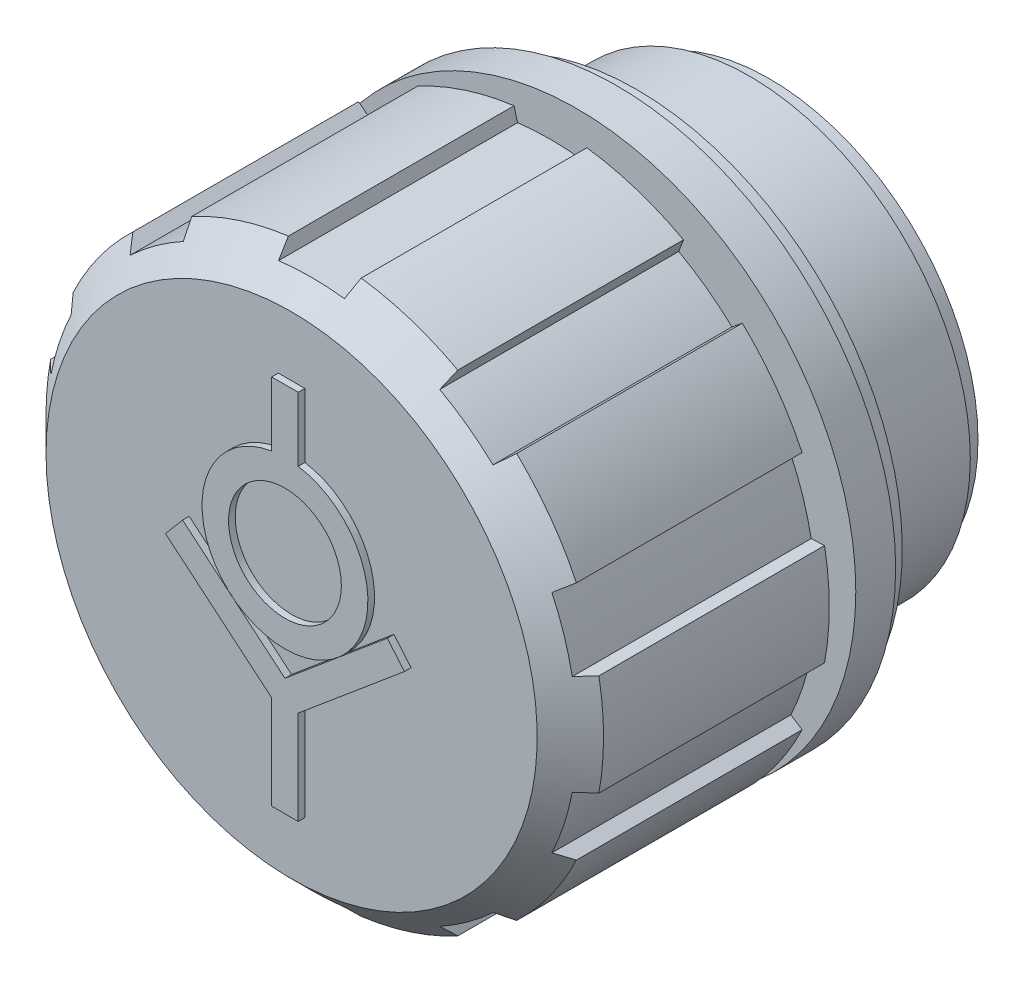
ISO-10303-21;
HEADER;
FILE_DESCRIPTION(('STEP AP214'),'2;1');
FILE_NAME('part.step','',(''),(''),'','','');
FILE_SCHEMA(('AUTOMOTIVE_DESIGN { 1 0 10303 214 1 1 1 1 }'));
ENDSEC;
DATA;
#1=APPLICATION_CONTEXT('core data for automotive mechanical design processes');
#2=APPLICATION_PROTOCOL_DEFINITION('international standard','automotive_design',2000,#1);
#3=PRODUCT_CONTEXT('',#1,'mechanical');
#4=PRODUCT('Part','Part','',(#3));
#5=PRODUCT_RELATED_PRODUCT_CATEGORY('part','',(#4));
#6=PRODUCT_DEFINITION_FORMATION('','',#4);
#7=PRODUCT_DEFINITION_CONTEXT('part definition',#1,'design');
#8=PRODUCT_DEFINITION('design','',#6,#7);
#9=PRODUCT_DEFINITION_SHAPE('','',#8);
#10=(LENGTH_UNIT() NAMED_UNIT(*) SI_UNIT(.MILLI.,.METRE.));
#11=(NAMED_UNIT(*) PLANE_ANGLE_UNIT() SI_UNIT($,.RADIAN.));
#12=(NAMED_UNIT(*) SI_UNIT($,.STERADIAN.) SOLID_ANGLE_UNIT());
#13=UNCERTAINTY_MEASURE_WITH_UNIT(LENGTH_MEASURE(1.E-05),#10,'distance_accuracy_value','');
#14=(GEOMETRIC_REPRESENTATION_CONTEXT(3) GLOBAL_UNCERTAINTY_ASSIGNED_CONTEXT((#13)) GLOBAL_UNIT_ASSIGNED_CONTEXT((#10,
#11,#12)) REPRESENTATION_CONTEXT('',''));
#15=CARTESIAN_POINT('',(0.,0.,0.));
#16=DIRECTION('',(0.,0.,1.));
#17=DIRECTION('',(1.,0.,0.));
#18=AXIS2_PLACEMENT_3D('',#15,#16,#17);
#19=CARTESIAN_POINT('',(0.,0.,5.5));
#20=DIRECTION('',(0.,0.,1.));
#21=DIRECTION('',(1.,0.,0.));
#22=AXIS2_PLACEMENT_3D('',#19,#20,#21);
#23=CYLINDRICAL_SURFACE('',#22,14.);
#24=CARTESIAN_POINT('',(0.,0.,4.5));
#25=DIRECTION('',(0.,0.,1.));
#26=DIRECTION('',(1.,0.,0.));
#27=AXIS2_PLACEMENT_3D('',#24,#25,#26);
#28=CIRCLE('',#27,14.);
#29=CARTESIAN_POINT('',(14.,0.,4.5));
#30=VERTEX_POINT('',#29);
#31=EDGE_CURVE('E967',#30,#30,#28,.T.);
#32=ORIENTED_EDGE('',*,*,#31,.T.);
#33=EDGE_LOOP('',(#32));
#34=FACE_BOUND('',#33,.T.);
#35=CARTESIAN_POINT('',(0.,0.,6.5));
#36=DIRECTION('',(0.,0.,1.));
#37=DIRECTION('',(1.,0.,0.));
#38=AXIS2_PLACEMENT_3D('',#35,#36,#37);
#39=CIRCLE('',#38,14.);
#40=CARTESIAN_POINT('',(14.,0.,6.5));
#41=VERTEX_POINT('',#40);
#42=EDGE_CURVE('E970',#41,#41,#39,.T.);
#43=ORIENTED_EDGE('',*,*,#42,.F.);
#44=EDGE_LOOP('',(#43));
#45=FACE_BOUND('',#44,.T.);
#46=ADVANCED_FACE('F14',(#34,#45),#23,.T.);
#47=CARTESIAN_POINT('',(0.,17.5,4.5));
#48=DIRECTION('',(0.,0.,1.));
#49=DIRECTION('',(1.,0.,0.));
#50=AXIS2_PLACEMENT_3D('',#47,#48,#49);
#51=PLANE('',#50);
#52=ORIENTED_EDGE('',*,*,#31,.F.);
#53=EDGE_LOOP('',(#52));
#54=FACE_BOUND('',#53,.T.);
#55=CARTESIAN_POINT('',(0.,0.,4.5));
#56=DIRECTION('',(0.,0.,1.));
#57=DIRECTION('',(1.,0.,0.));
#58=AXIS2_PLACEMENT_3D('',#55,#56,#57);
#59=CIRCLE('',#58,21.);
#60=CARTESIAN_POINT('',(21.,0.,4.5));
#61=VERTEX_POINT('',#60);
#62=EDGE_CURVE('E964',#61,#61,#59,.T.);
#63=ORIENTED_EDGE('',*,*,#62,.T.);
#64=EDGE_LOOP('',(#63));
#65=FACE_BOUND('',#64,.T.);
#66=ADVANCED_FACE('F1010',(#54,#65),#51,.T.);
#67=CARTESIAN_POINT('',(0.,0.,3.));
#68=DIRECTION('',(0.,0.,1.));
#69=DIRECTION('',(1.,0.,0.));
#70=AXIS2_PLACEMENT_3D('',#67,#68,#69);
#71=CYLINDRICAL_SURFACE('',#70,21.);
#72=CARTESIAN_POINT('',(0.,0.,1.5));
#73=DIRECTION('',(0.,0.,1.));
#74=DIRECTION('',(1.,0.,0.));
#75=AXIS2_PLACEMENT_3D('',#72,#73,#74);
#76=CIRCLE('',#75,21.);
#77=CARTESIAN_POINT('',(21.,0.,1.5));
#78=VERTEX_POINT('',#77);
#79=EDGE_CURVE('E961',#78,#78,#76,.T.);
#80=ORIENTED_EDGE('',*,*,#79,.T.);
#81=EDGE_LOOP('',(#80));
#82=FACE_BOUND('',#81,.T.);
#83=ORIENTED_EDGE('',*,*,#62,.F.);
#84=EDGE_LOOP('',(#83));
#85=FACE_BOUND('',#84,.T.);
#86=ADVANCED_FACE('F1014',(#82,#85),#71,.T.);
#87=CARTESIAN_POINT('',(0.,20.0454545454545,1.5));
#88=DIRECTION('',(0.,0.,-1.));
#89=DIRECTION('',(-1.,0.,0.));
#90=AXIS2_PLACEMENT_3D('',#87,#88,#89);
#91=PLANE('',#90);
#92=CARTESIAN_POINT('',(0.,0.,1.5));
#93=DIRECTION('',(0.,0.,-1.));
#94=DIRECTION('',(0.,1.,0.));
#95=AXIS2_PLACEMENT_3D('',#92,#93,#94);
#96=CIRCLE('',#95,20.);
#97=CARTESIAN_POINT('',(0.,20.,1.49999999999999));
#98=VERTEX_POINT('',#97);
#99=EDGE_CURVE('E934',#98,#98,#96,.T.);
#100=ORIENTED_EDGE('',*,*,#99,.F.);
#101=EDGE_LOOP('',(#100));
#102=FACE_BOUND('',#101,.T.);
#103=ORIENTED_EDGE('',*,*,#79,.F.);
#104=EDGE_LOOP('',(#103));
#105=FACE_BOUND('',#104,.T.);
#106=ADVANCED_FACE('F1018',(#102,#105),#91,.T.);
#107=CARTESIAN_POINT('',(0.,19.9,6.5));
#108=DIRECTION('',(0.,0.,-1.));
#109=DIRECTION('',(-1.,0.,0.));
#110=AXIS2_PLACEMENT_3D('',#107,#108,#109);
#111=PLANE('',#110);
#112=CARTESIAN_POINT('',(0.,0.,6.5));
#113=DIRECTION('',(0.,0.,1.));
#114=DIRECTION('',(1.,0.,0.));
#115=AXIS2_PLACEMENT_3D('',#112,#113,#114);
#116=CIRCLE('',#115,21.);
#117=CARTESIAN_POINT('',(-20.648353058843,3.82694603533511,6.5));
#118=VERTEX_POINT('',#117);
#119=CARTESIAN_POINT('',(-20.648353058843,-3.82694603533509,6.5));
#120=VERTEX_POINT('',#119);
#121=EDGE_CURVE('E374',#118,#120,#116,.T.);
#122=ORIENTED_EDGE('',*,*,#121,.F.);
#123=DIRECTION('',(0.998629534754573,-0.0523359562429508,0.));
#124=VECTOR('',#123,1.);
#125=CARTESIAN_POINT('',(-20.648353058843,3.82694603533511,6.5));
#126=LINE('',#125,#124);
#127=CARTESIAN_POINT('',(-19.640669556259,3.77413558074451,6.5));
#128=VERTEX_POINT('',#127);
#129=EDGE_CURVE('E801',#118,#128,#126,.T.);
#130=ORIENTED_EDGE('',*,*,#129,.T.);
#131=CARTESIAN_POINT('',(2.00278519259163E-13,-1.02151947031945E-13,6.5));
#132=DIRECTION('',(0.,0.,1.));
#133=DIRECTION('',(1.,0.,0.));
#134=AXIS2_PLACEMENT_3D('',#131,#132,#133);
#135=CIRCLE('',#134,20.);
#136=CARTESIAN_POINT('',(-18.10801668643,8.49115608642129,6.5));
#137=VERTEX_POINT('',#136);
#138=EDGE_CURVE('E379',#137,#128,#135,.T.);
#139=ORIENTED_EDGE('',*,*,#138,.F.);
#140=DIRECTION('',(-0.838670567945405,0.544639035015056,0.));
#141=VECTOR('',#140,1.);
#142=CARTESIAN_POINT('',(-18.1080166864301,8.49115608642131,6.5));
#143=LINE('',#142,#141);
#144=CARTESIAN_POINT('',(-18.954290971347,9.04073303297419,6.5));
#145=VERTEX_POINT('',#144);
#146=EDGE_CURVE('E767',#137,#145,#143,.T.);
#147=ORIENTED_EDGE('',*,*,#146,.T.);
#148=CARTESIAN_POINT('',(-3.37957603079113E-13,3.33055478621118E-13,6.5));
#149=DIRECTION('',(0.,0.,1.));
#150=DIRECTION('',(1.,0.,0.));
#151=AXIS2_PLACEMENT_3D('',#148,#149,#150);
#152=CIRCLE('',#151,20.9999999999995);
#153=CARTESIAN_POINT('',(-14.4554460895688,15.232861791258,6.5));
#154=VERTEX_POINT('',#153);
#155=EDGE_CURVE('E384',#154,#145,#152,.T.);
#156=ORIENTED_EDGE('',*,*,#155,.F.);
#157=DIRECTION('',(0.777145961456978,-0.629320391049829,0.));
#158=VECTOR('',#157,1.);
#159=CARTESIAN_POINT('',(-14.4554460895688,15.232861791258,6.5));
#160=LINE('',#159,#158);
#161=CARTESIAN_POINT('',(-13.6712542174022,14.5978357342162,6.5));
#162=VERTEX_POINT('',#161);
#163=EDGE_CURVE('E769',#154,#162,#160,.T.);
#164=ORIENTED_EDGE('',*,*,#163,.T.);
#165=CARTESIAN_POINT('',(2.94425431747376E-13,-2.88669415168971E-13,6.5));
#166=DIRECTION('',(0.,0.,1.));
#167=DIRECTION('',(1.,0.,0.));
#168=AXIS2_PLACEMENT_3D('',#165,#166,#167);
#169=CIRCLE('',#168,20.0000000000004);
#170=CARTESIAN_POINT('',(-9.65871691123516,17.5131147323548,6.5));
#171=VERTEX_POINT('',#170);
#172=EDGE_CURVE('E389',#171,#162,#169,.T.);
#173=ORIENTED_EDGE('',*,*,#172,.F.);
#174=DIRECTION('',(-0.358367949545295,0.933580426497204,0.));
#175=VECTOR('',#174,1.);
#176=CARTESIAN_POINT('',(-9.65871691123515,17.5131147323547,6.5));
#177=LINE('',#176,#175);
#178=CARTESIAN_POINT('',(-10.0203339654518,18.4551593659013,6.5));
#179=VERTEX_POINT('',#178);
#180=EDGE_CURVE('E771',#171,#179,#177,.T.);
#181=ORIENTED_EDGE('',*,*,#180,.T.);
#182=CARTESIAN_POINT('',(0.,0.,6.5));
#183=DIRECTION('',(0.,0.,1.));
#184=DIRECTION('',(1.,0.,0.));
#185=AXIS2_PLACEMENT_3D('',#182,#183,#184);
#186=CIRCLE('',#185,21.);
#187=CARTESIAN_POINT('',(-2.74105003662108,20.82034208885,6.5));
#188=VERTEX_POINT('',#187);
#189=EDGE_CURVE('E394',#188,#179,#186,.T.);
#190=ORIENTED_EDGE('',*,*,#189,.F.);
#191=DIRECTION('',(0.258819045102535,-0.965925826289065,0.));
#192=VECTOR('',#191,1.);
#193=CARTESIAN_POINT('',(-2.74105003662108,20.82034208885,6.5));
#194=LINE('',#193,#192);
#195=CARTESIAN_POINT('',(-2.47988443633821,19.8456587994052,6.5));
#196=VERTEX_POINT('',#195);
#197=EDGE_CURVE('E773',#188,#196,#194,.T.);
#198=ORIENTED_EDGE('',*,*,#197,.T.);
#199=CARTESIAN_POINT('',(0.,3.79240756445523E-13,6.5));
#200=DIRECTION('',(0.,0.,1.));
#201=DIRECTION('',(1.,0.,0.));
#202=AXIS2_PLACEMENT_3D('',#199,#200,#201);
#203=CIRCLE('',#202,19.9999999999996);
#204=CARTESIAN_POINT('',(2.4798844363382,19.8456587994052,6.5));
#205=VERTEX_POINT('',#204);
#206=EDGE_CURVE('E399',#205,#196,#203,.T.);
#207=ORIENTED_EDGE('',*,*,#206,.F.);
#208=DIRECTION('',(0.258819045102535,0.965925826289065,0.));
#209=VECTOR('',#208,1.);
#210=CARTESIAN_POINT('',(2.47988443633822,19.8456587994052,6.5));
#211=LINE('',#210,#209);
#212=CARTESIAN_POINT('',(2.74105003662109,20.82034208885,6.5));
#213=VERTEX_POINT('',#212);
#214=EDGE_CURVE('E775',#205,#213,#211,.T.);
#215=ORIENTED_EDGE('',*,*,#214,.T.);
#216=CARTESIAN_POINT('',(-1.30123852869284E-13,-4.59199671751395E-13,6.5));
#217=DIRECTION('',(0.,0.,1.));
#218=DIRECTION('',(1.,0.,0.));
#219=AXIS2_PLACEMENT_3D('',#216,#217,#218);
#220=CIRCLE('',#219,21.0000000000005);
#221=CARTESIAN_POINT('',(10.0203339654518,18.4551593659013,6.5));
#222=VERTEX_POINT('',#221);
#223=EDGE_CURVE('E404',#222,#213,#220,.T.);
#224=ORIENTED_EDGE('',*,*,#223,.F.);
#225=DIRECTION('',(-0.358367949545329,-0.933580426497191,0.));
#226=VECTOR('',#225,1.);
#227=CARTESIAN_POINT('',(10.0203339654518,18.4551593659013,6.5));
#228=LINE('',#227,#226);
#229=CARTESIAN_POINT('',(9.65871691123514,17.5131147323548,6.5));
#230=VERTEX_POINT('',#229);
#231=EDGE_CURVE('E777',#222,#230,#228,.T.);
#232=ORIENTED_EDGE('',*,*,#231,.T.);
#233=CARTESIAN_POINT('',(0.,2.54895777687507E-13,6.5));
#234=DIRECTION('',(0.,0.,1.));
#235=DIRECTION('',(1.,0.,0.));
#236=AXIS2_PLACEMENT_3D('',#233,#234,#235);
#237=CIRCLE('',#236,20.);
#238=CARTESIAN_POINT('',(13.6712542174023,14.5978357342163,6.5));
#239=VERTEX_POINT('',#238);
#240=EDGE_CURVE('E409',#239,#230,#237,.T.);
#241=ORIENTED_EDGE('',*,*,#240,.F.);
#242=DIRECTION('',(0.777145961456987,0.629320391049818,0.));
#243=VECTOR('',#242,1.);
#244=CARTESIAN_POINT('',(13.6712542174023,14.5978357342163,6.5));
#245=LINE('',#244,#243);
#246=CARTESIAN_POINT('',(14.4554460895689,15.232861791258,6.5));
#247=VERTEX_POINT('',#246);
#248=EDGE_CURVE('E779',#239,#247,#245,.T.);
#249=ORIENTED_EDGE('',*,*,#248,.T.);
#250=CARTESIAN_POINT('',(0.,0.,6.5));
#251=DIRECTION('',(0.,0.,1.));
#252=DIRECTION('',(1.,0.,0.));
#253=AXIS2_PLACEMENT_3D('',#250,#251,#252);
#254=CIRCLE('',#253,21.);
#255=CARTESIAN_POINT('',(18.9542909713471,9.0407330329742,6.5));
#256=VERTEX_POINT('',#255);
#257=EDGE_CURVE('E414',#256,#247,#254,.T.);
#258=ORIENTED_EDGE('',*,*,#257,.F.);
#259=DIRECTION('',(-0.838670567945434,-0.544639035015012,0.));
#260=VECTOR('',#259,1.);
#261=CARTESIAN_POINT('',(18.9542909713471,9.04073303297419,6.5));
#262=LINE('',#261,#260);
#263=CARTESIAN_POINT('',(18.1080166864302,8.49115608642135,6.5));
#264=VERTEX_POINT('',#263);
#265=EDGE_CURVE('E781',#256,#264,#262,.T.);
#266=ORIENTED_EDGE('',*,*,#265,.T.);
#267=CARTESIAN_POINT('',(-3.68155669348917E-13,0.,6.5));
#268=DIRECTION('',(0.,0.,1.));
#269=DIRECTION('',(1.,0.,0.));
#270=AXIS2_PLACEMENT_3D('',#267,#268,#269);
#271=CIRCLE('',#270,20.0000000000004);
#272=CARTESIAN_POINT('',(19.640669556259,3.77413558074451,6.5));
#273=VERTEX_POINT('',#272);
#274=EDGE_CURVE('E419',#273,#264,#271,.T.);
#275=ORIENTED_EDGE('',*,*,#274,.F.);
#276=DIRECTION('',(0.998629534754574,0.0523359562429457,0.));
#277=VECTOR('',#276,1.);
#278=CARTESIAN_POINT('',(19.640669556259,3.77413558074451,6.5));
#279=LINE('',#278,#277);
#280=CARTESIAN_POINT('',(20.648353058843,3.82694603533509,6.5));
#281=VERTEX_POINT('',#280);
#282=EDGE_CURVE('E783',#273,#281,#279,.T.);
#283=ORIENTED_EDGE('',*,*,#282,.T.);
#284=CARTESIAN_POINT('',(0.,0.,6.5));
#285=DIRECTION('',(0.,0.,1.));
#286=DIRECTION('',(1.,0.,0.));
#287=AXIS2_PLACEMENT_3D('',#284,#285,#286);
#288=CIRCLE('',#287,21.);
#289=CARTESIAN_POINT('',(20.648353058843,-3.82694603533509,6.5));
#290=VERTEX_POINT('',#289);
#291=EDGE_CURVE('E424',#290,#281,#288,.T.);
#292=ORIENTED_EDGE('',*,*,#291,.F.);
#293=DIRECTION('',(-0.998629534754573,0.0523359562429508,0.));
#294=VECTOR('',#293,1.);
#295=CARTESIAN_POINT('',(20.648353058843,-3.8269460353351,6.5));
#296=LINE('',#295,#294);
#297=CARTESIAN_POINT('',(19.640669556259,-3.77413558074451,6.5));
#298=VERTEX_POINT('',#297);
#299=EDGE_CURVE('E785',#290,#298,#296,.T.);
#300=ORIENTED_EDGE('',*,*,#299,.T.);
#301=CARTESIAN_POINT('',(0.,0.,6.5));
#302=DIRECTION('',(0.,0.,1.));
#303=DIRECTION('',(1.,0.,0.));
#304=AXIS2_PLACEMENT_3D('',#301,#302,#303);
#305=CIRCLE('',#304,20.);
#306=CARTESIAN_POINT('',(18.1080166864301,-8.4911560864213,6.5));
#307=VERTEX_POINT('',#306);
#308=EDGE_CURVE('E429',#307,#298,#305,.T.);
#309=ORIENTED_EDGE('',*,*,#308,.F.);
#310=DIRECTION('',(0.838670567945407,-0.544639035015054,0.));
#311=VECTOR('',#310,1.);
#312=CARTESIAN_POINT('',(18.1080166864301,-8.49115608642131,6.5));
#313=LINE('',#312,#311);
#314=CARTESIAN_POINT('',(18.954290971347,-9.0407330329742,6.5));
#315=VERTEX_POINT('',#314);
#316=EDGE_CURVE('E787',#307,#315,#313,.T.);
#317=ORIENTED_EDGE('',*,*,#316,.T.);
#318=CARTESIAN_POINT('',(2.67780079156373E-13,-2.95774842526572E-13,6.5));
#319=DIRECTION('',(0.,0.,1.));
#320=DIRECTION('',(1.,0.,0.));
#321=AXIS2_PLACEMENT_3D('',#318,#319,#320);
#322=CIRCLE('',#321,20.9999999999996);
#323=CARTESIAN_POINT('',(14.4554460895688,-15.232861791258,6.5));
#324=VERTEX_POINT('',#323);
#325=EDGE_CURVE('E434',#324,#315,#322,.T.);
#326=ORIENTED_EDGE('',*,*,#325,.F.);
#327=DIRECTION('',(-0.777145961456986,0.629320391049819,0.));
#328=VECTOR('',#327,1.);
#329=CARTESIAN_POINT('',(14.4554460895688,-15.232861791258,6.5));
#330=LINE('',#329,#328);
#331=CARTESIAN_POINT('',(13.6712542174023,-14.5978357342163,6.5));
#332=VERTEX_POINT('',#331);
#333=EDGE_CURVE('E656',#324,#332,#330,.T.);
#334=ORIENTED_EDGE('',*,*,#333,.T.);
#335=CARTESIAN_POINT('',(1.68304096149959E-13,-1.67877150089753E-13,6.5));
#336=DIRECTION('',(0.,0.,1.));
#337=DIRECTION('',(1.,0.,0.));
#338=AXIS2_PLACEMENT_3D('',#335,#336,#337);
#339=CIRCLE('',#338,20.);
#340=CARTESIAN_POINT('',(9.65871691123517,-17.5131147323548,6.5));
#341=VERTEX_POINT('',#340);
#342=EDGE_CURVE('E319',#341,#332,#339,.T.);
#343=ORIENTED_EDGE('',*,*,#342,.F.);
#344=DIRECTION('',(0.358367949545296,-0.933580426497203,0.));
#345=VECTOR('',#344,1.);
#346=CARTESIAN_POINT('',(9.65871691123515,-17.5131147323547,6.5));
#347=LINE('',#346,#345);
#348=CARTESIAN_POINT('',(10.0203339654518,-18.4551593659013,6.5));
#349=VERTEX_POINT('',#348);
#350=EDGE_CURVE('E315',#341,#349,#347,.T.);
#351=ORIENTED_EDGE('',*,*,#350,.T.);
#352=CARTESIAN_POINT('',(1.51872795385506E-13,0.,6.5));
#353=DIRECTION('',(0.,0.,1.));
#354=DIRECTION('',(1.,0.,0.));
#355=AXIS2_PLACEMENT_3D('',#352,#353,#354);
#356=CIRCLE('',#355,21.);
#357=CARTESIAN_POINT('',(2.74105003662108,-20.82034208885,6.5));
#358=VERTEX_POINT('',#357);
#359=EDGE_CURVE('E338',#358,#349,#356,.T.);
#360=ORIENTED_EDGE('',*,*,#359,.F.);
#361=DIRECTION('',(-0.258819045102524,0.965925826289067,0.));
#362=VECTOR('',#361,1.);
#363=CARTESIAN_POINT('',(2.74105003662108,-20.82034208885,6.5));
#364=LINE('',#363,#362);
#365=CARTESIAN_POINT('',(2.47988443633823,-19.8456587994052,6.5));
#366=VERTEX_POINT('',#365);
#367=EDGE_CURVE('E452',#358,#366,#364,.T.);
#368=ORIENTED_EDGE('',*,*,#367,.T.);
#369=CARTESIAN_POINT('',(0.,-1.46560868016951E-13,6.5));
#370=DIRECTION('',(0.,0.,1.));
#371=DIRECTION('',(1.,0.,0.));
#372=AXIS2_PLACEMENT_3D('',#369,#370,#371);
#373=CIRCLE('',#372,20.);
#374=CARTESIAN_POINT('',(-2.47988443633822,-19.8456587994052,6.5));
#375=VERTEX_POINT('',#374);
#376=EDGE_CURVE('E349',#375,#366,#373,.T.);
#377=ORIENTED_EDGE('',*,*,#376,.F.);
#378=DIRECTION('',(-0.258819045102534,-0.965925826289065,0.));
#379=VECTOR('',#378,1.);
#380=CARTESIAN_POINT('',(-2.47988443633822,-19.8456587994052,6.5));
#381=LINE('',#380,#379);
#382=CARTESIAN_POINT('',(-2.74105003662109,-20.82034208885,6.5));
#383=VERTEX_POINT('',#382);
#384=EDGE_CURVE('E791',#375,#383,#381,.T.);
#385=ORIENTED_EDGE('',*,*,#384,.T.);
#386=CARTESIAN_POINT('',(0.,2.122632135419E-13,6.5));
#387=DIRECTION('',(0.,0.,1.));
#388=DIRECTION('',(1.,0.,0.));
#389=AXIS2_PLACEMENT_3D('',#386,#387,#388);
#390=CIRCLE('',#389,21.);
#391=CARTESIAN_POINT('',(-10.0203339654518,-18.4551593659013,6.5));
#392=VERTEX_POINT('',#391);
#393=EDGE_CURVE('E354',#392,#383,#390,.T.);
#394=ORIENTED_EDGE('',*,*,#393,.F.);
#395=DIRECTION('',(0.358367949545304,0.9335804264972,0.));
#396=VECTOR('',#395,1.);
#397=CARTESIAN_POINT('',(-10.0203339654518,-18.4551593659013,6.5));
#398=LINE('',#397,#396);
#399=CARTESIAN_POINT('',(-9.65871691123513,-17.5131147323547,6.5));
#400=VERTEX_POINT('',#399);
#401=EDGE_CURVE('E793',#392,#400,#398,.T.);
#402=ORIENTED_EDGE('',*,*,#401,.T.);
#403=CARTESIAN_POINT('',(1.68304096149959E-13,4.2187332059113E-13,6.5));
#404=DIRECTION('',(0.,0.,1.));
#405=DIRECTION('',(1.,0.,0.));
#406=AXIS2_PLACEMENT_3D('',#403,#404,#405);
#407=CIRCLE('',#406,20.0000000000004);
#408=CARTESIAN_POINT('',(-13.6712542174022,-14.5978357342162,6.5));
#409=VERTEX_POINT('',#408);
#410=EDGE_CURVE('E359',#409,#400,#407,.T.);
#411=ORIENTED_EDGE('',*,*,#410,.F.);
#412=DIRECTION('',(-0.777145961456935,-0.629320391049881,0.));
#413=VECTOR('',#412,1.);
#414=CARTESIAN_POINT('',(-13.6712542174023,-14.5978357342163,6.5));
#415=LINE('',#414,#413);
#416=CARTESIAN_POINT('',(-14.4554460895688,-15.2328617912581,6.5));
#417=VERTEX_POINT('',#416);
#418=EDGE_CURVE('E795',#409,#417,#415,.T.);
#419=ORIENTED_EDGE('',*,*,#418,.T.);
#420=CARTESIAN_POINT('',(0.,0.,6.5));
#421=DIRECTION('',(0.,0.,1.));
#422=DIRECTION('',(1.,0.,0.));
#423=AXIS2_PLACEMENT_3D('',#420,#421,#422);
#424=CIRCLE('',#423,21.);
#425=CARTESIAN_POINT('',(-18.9542909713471,-9.04073303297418,6.5));
#426=VERTEX_POINT('',#425);
#427=EDGE_CURVE('E364',#426,#417,#424,.T.);
#428=ORIENTED_EDGE('',*,*,#427,.F.);
#429=DIRECTION('',(0.838670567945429,0.54463903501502,0.));
#430=VECTOR('',#429,1.);
#431=CARTESIAN_POINT('',(-18.9542909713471,-9.04073303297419,6.5));
#432=LINE('',#431,#430);
#433=CARTESIAN_POINT('',(-18.1080166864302,-8.49115608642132,6.5));
#434=VERTEX_POINT('',#433);
#435=EDGE_CURVE('E797',#426,#434,#432,.T.);
#436=ORIENTED_EDGE('',*,*,#435,.T.);
#437=CARTESIAN_POINT('',(-2.04730840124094E-13,-1.31017745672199E-13,6.5));
#438=DIRECTION('',(0.,0.,1.));
#439=DIRECTION('',(1.,0.,0.));
#440=AXIS2_PLACEMENT_3D('',#437,#438,#439);
#441=CIRCLE('',#440,20.);
#442=CARTESIAN_POINT('',(-19.640669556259,-3.77413558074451,6.5));
#443=VERTEX_POINT('',#442);
#444=EDGE_CURVE('E369',#443,#434,#441,.T.);
#445=ORIENTED_EDGE('',*,*,#444,.F.);
#446=DIRECTION('',(-0.998629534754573,-0.0523359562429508,0.));
#447=VECTOR('',#446,1.);
#448=CARTESIAN_POINT('',(-19.640669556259,-3.77413558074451,6.5));
#449=LINE('',#448,#447);
#450=EDGE_CURVE('E799',#443,#120,#449,.T.);
#451=ORIENTED_EDGE('',*,*,#450,.T.);
#452=EDGE_LOOP('',(#122,#130,#139,#147,#156,#164,#173,#181,#190,#198,#207,#215,#224,#232,#241,
#249,#258,#266,#275,#283,#292,#300,#309,#317,#326,#334,#343,#351,#360,#368,#377,#385,#394,#402,
#411,#419,#428,#436,#445,#451));
#453=FACE_BOUND('',#452,.T.);
#454=ORIENTED_EDGE('',*,*,#42,.T.);
#455=EDGE_LOOP('',(#454));
#456=FACE_BOUND('',#455,.T.);
#457=ADVANCED_FACE('F1022',(#453,#456),#111,.T.);
#458=CARTESIAN_POINT('',(0.,0.,26.5));
#459=DIRECTION('',(0.,0.,1.));
#460=DIRECTION('',(1.,0.,0.));
#461=AXIS2_PLACEMENT_3D('',#458,#459,#460);
#462=CYLINDRICAL_SURFACE('',#461,21.);
#463=ORIENTED_EDGE('',*,*,#121,.T.);
#464=DIRECTION('',(0.,0.,1.));
#465=VECTOR('',#464,1.);
#466=CARTESIAN_POINT('',(-20.648353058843,-3.82694603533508,26.5));
#467=LINE('',#466,#465);
#468=CARTESIAN_POINT('',(-20.648353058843,-3.82694603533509,23.5));
#469=VERTEX_POINT('',#468);
#470=EDGE_CURVE('E377',#120,#469,#467,.T.);
#471=ORIENTED_EDGE('',*,*,#470,.T.);
#472=CARTESIAN_POINT('',(0.,0.,23.5));
#473=DIRECTION('',(0.,0.,-1.));
#474=DIRECTION('',(0.,1.,0.));
#475=AXIS2_PLACEMENT_3D('',#472,#473,#474);
#476=CIRCLE('',#475,21.);
#477=CARTESIAN_POINT('',(-20.648353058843,3.82694603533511,23.5));
#478=VERTEX_POINT('',#477);
#479=EDGE_CURVE('E727',#478,#469,#476,.F.);
#480=ORIENTED_EDGE('',*,*,#479,.F.);
#481=DIRECTION('',(0.,0.,1.));
#482=VECTOR('',#481,1.);
#483=CARTESIAN_POINT('',(-20.648353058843,3.82694603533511,26.5));
#484=LINE('',#483,#482);
#485=EDGE_CURVE('E378',#478,#118,#484,.F.);
#486=ORIENTED_EDGE('',*,*,#485,.T.);
#487=EDGE_LOOP('',(#463,#471,#480,#486));
#488=FACE_BOUND('',#487,.T.);
#489=ADVANCED_FACE('F1565',(#488),#462,.T.);
#490=CARTESIAN_POINT('',(-20.648353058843,3.82694603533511,26.5));
#491=DIRECTION('',(-0.0523359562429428,-0.998629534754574,0.));
#492=DIRECTION('',(0.998629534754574,-0.0523359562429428,0.));
#493=AXIS2_PLACEMENT_3D('',#490,#491,#492);
#494=PLANE('',#493);
#495=DIRECTION('',(0.,0.,1.));
#496=VECTOR('',#495,1.);
#497=CARTESIAN_POINT('',(-19.640669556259,3.77413558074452,26.5));
#498=LINE('',#497,#496);
#499=CARTESIAN_POINT('',(-19.640669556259,3.77413558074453,24.5));
#500=VERTEX_POINT('',#499);
#501=EDGE_CURVE('E382',#128,#500,#498,.T.);
#502=ORIENTED_EDGE('',*,*,#501,.F.);
#503=ORIENTED_EDGE('',*,*,#129,.F.);
#504=ORIENTED_EDGE('',*,*,#485,.F.);
#505=CARTESIAN_POINT('',(-19.640669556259,3.77413558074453,24.5));
#506=CARTESIAN_POINT('',(-19.8086537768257,3.78293926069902,24.3333706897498));
#507=CARTESIAN_POINT('',(-19.9766195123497,3.79174197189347,24.1667227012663));
#508=CARTESIAN_POINT('',(-20.312514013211,3.809345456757,23.8333893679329));
#509=CARTESIAN_POINT('',(-20.4804427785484,3.81814623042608,23.6667040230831));
#510=CARTESIAN_POINT('',(-20.648353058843,3.82694603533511,23.5));
#511=B_SPLINE_CURVE_WITH_KNOTS('',3,(#505,#506,#507,#508,#509,#510),.UNSPECIFIED.,.F.,.F.,(4,2,
4),(0.,0.71031947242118,1.42063894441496),.UNSPECIFIED.);
#512=EDGE_CURVE('E590',#500,#478,#511,.T.);
#513=ORIENTED_EDGE('',*,*,#512,.F.);
#514=EDGE_LOOP('',(#502,#503,#504,#513));
#515=FACE_BOUND('',#514,.T.);
#516=ADVANCED_FACE('F1556',(#515),#494,.F.);
#517=CARTESIAN_POINT('',(2.04360221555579E-13,0.,26.5));
#518=DIRECTION('',(0.,0.,1.));
#519=DIRECTION('',(1.,0.,0.));
#520=AXIS2_PLACEMENT_3D('',#517,#518,#519);
#521=CYLINDRICAL_SURFACE('',#520,20.);
#522=ORIENTED_EDGE('',*,*,#138,.T.);
#523=ORIENTED_EDGE('',*,*,#501,.T.);
#524=CARTESIAN_POINT('',(0.,0.,24.5));
#525=DIRECTION('',(0.,0.,-1.));
#526=DIRECTION('',(0.,1.,0.));
#527=AXIS2_PLACEMENT_3D('',#524,#525,#526);
#528=CIRCLE('',#527,20.);
#529=CARTESIAN_POINT('',(-18.10801668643,8.4911560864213,24.5));
#530=VERTEX_POINT('',#529);
#531=EDGE_CURVE('E720',#530,#500,#528,.F.);
#532=ORIENTED_EDGE('',*,*,#531,.F.);
#533=DIRECTION('',(0.,0.,1.));
#534=VECTOR('',#533,1.);
#535=CARTESIAN_POINT('',(-18.10801668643,8.4911560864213,26.5));
#536=LINE('',#535,#534);
#537=EDGE_CURVE('E383',#530,#137,#536,.F.);
#538=ORIENTED_EDGE('',*,*,#537,.T.);
#539=EDGE_LOOP('',(#522,#523,#532,#538));
#540=FACE_BOUND('',#539,.T.);
#541=ADVANCED_FACE('F1547',(#540),#521,.T.);
#542=CARTESIAN_POINT('',(-18.1080166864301,8.49115608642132,26.5));
#543=DIRECTION('',(0.54463903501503,0.838670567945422,0.));
#544=DIRECTION('',(-0.838670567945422,0.54463903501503,0.));
#545=AXIS2_PLACEMENT_3D('',#542,#543,#544);
#546=PLANE('',#545);
#547=DIRECTION('',(0.,0.,1.));
#548=VECTOR('',#547,1.);
#549=CARTESIAN_POINT('',(-18.954290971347,9.0407330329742,26.5));
#550=LINE('',#549,#548);
#551=CARTESIAN_POINT('',(-18.954290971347,9.04073303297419,23.5));
#552=VERTEX_POINT('',#551);
#553=EDGE_CURVE('E387',#145,#552,#550,.T.);
#554=ORIENTED_EDGE('',*,*,#553,.F.);
#555=ORIENTED_EDGE('',*,*,#146,.F.);
#556=ORIENTED_EDGE('',*,*,#537,.F.);
#557=CARTESIAN_POINT('',(-18.954290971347,9.04073303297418,23.5));
#558=CARTESIAN_POINT('',(-18.8132763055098,8.94915703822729,23.6667040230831));
#559=CARTESIAN_POINT('',(-18.6722461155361,8.85757096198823,23.8333893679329));
#560=CARTESIAN_POINT('',(-18.3901546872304,8.67437864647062,24.1667227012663));
#561=CARTESIAN_POINT('',(-18.2490934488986,8.58277240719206,24.3333706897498));
#562=CARTESIAN_POINT('',(-18.1080166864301,8.49115608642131,24.5));
#563=B_SPLINE_CURVE_WITH_KNOTS('',3,(#557,#558,#559,#560,#561,#562),.UNSPECIFIED.,.F.,.F.,(4,2,
4),(0.,0.710319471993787,1.42063894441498),.UNSPECIFIED.);
#564=EDGE_CURVE('E597',#552,#530,#563,.T.);
#565=ORIENTED_EDGE('',*,*,#564,.F.);
#566=EDGE_LOOP('',(#554,#555,#556,#565));
#567=FACE_BOUND('',#566,.T.);
#568=ADVANCED_FACE('F615',(#567),#546,.F.);
#569=CARTESIAN_POINT('',(-3.33875900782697E-13,3.4121888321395E-13,26.5));
#570=DIRECTION('',(0.,0.,1.));
#571=DIRECTION('',(1.,0.,0.));
#572=AXIS2_PLACEMENT_3D('',#569,#570,#571);
#573=CYLINDRICAL_SURFACE('',#572,20.9999999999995);
#574=ORIENTED_EDGE('',*,*,#155,.T.);
#575=ORIENTED_EDGE('',*,*,#553,.T.);
#576=CARTESIAN_POINT('',(0.,0.,23.5));
#577=DIRECTION('',(0.,0.,-1.));
#578=DIRECTION('',(0.,1.,0.));
#579=AXIS2_PLACEMENT_3D('',#576,#577,#578);
#580=CIRCLE('',#579,21.);
#581=CARTESIAN_POINT('',(-14.4554460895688,15.232861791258,23.5));
#582=VERTEX_POINT('',#581);
#583=EDGE_CURVE('E713',#582,#552,#580,.F.);
#584=ORIENTED_EDGE('',*,*,#583,.F.);
#585=DIRECTION('',(0.,0.,1.));
#586=VECTOR('',#585,1.);
#587=CARTESIAN_POINT('',(-14.4554460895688,15.232861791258,26.5));
#588=LINE('',#587,#586);
#589=EDGE_CURVE('E388',#582,#154,#588,.F.);
#590=ORIENTED_EDGE('',*,*,#589,.T.);
#591=EDGE_LOOP('',(#574,#575,#584,#590));
#592=FACE_BOUND('',#591,.T.);
#593=ADVANCED_FACE('F613',(#592),#573,.T.);
#594=CARTESIAN_POINT('',(-14.4554460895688,15.232861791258,26.5));
#595=DIRECTION('',(-0.629320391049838,-0.777145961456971,0.));
#596=DIRECTION('',(0.777145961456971,-0.629320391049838,0.));
#597=AXIS2_PLACEMENT_3D('',#594,#595,#596);
#598=PLANE('',#597);
#599=DIRECTION('',(0.,0.,1.));
#600=VECTOR('',#599,1.);
#601=CARTESIAN_POINT('',(-13.6712542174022,14.5978357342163,26.5));
#602=LINE('',#601,#600);
#603=CARTESIAN_POINT('',(-13.6712542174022,14.5978357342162,24.5));
#604=VERTEX_POINT('',#603);
#605=EDGE_CURVE('E392',#162,#604,#602,.T.);
#606=ORIENTED_EDGE('',*,*,#605,.F.);
#607=ORIENTED_EDGE('',*,*,#163,.F.);
#608=ORIENTED_EDGE('',*,*,#589,.F.);
#609=CARTESIAN_POINT('',(-13.6712542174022,14.5978357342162,24.5));
#610=CARTESIAN_POINT('',(-13.8019816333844,14.7036967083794,24.3333706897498));
#611=CARTESIAN_POINT('',(-13.9326946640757,14.8095460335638,24.1667227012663));
#612=CARTESIAN_POINT('',(-14.1940919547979,15.021221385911,23.8333893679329));
#613=CARTESIAN_POINT('',(-14.3247762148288,15.127047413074,23.6667040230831));
#614=CARTESIAN_POINT('',(-14.4554460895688,15.232861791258,23.5));
#615=B_SPLINE_CURVE_WITH_KNOTS('',3,(#609,#610,#611,#612,#613,#614),.UNSPECIFIED.,.F.,.F.,(4,2,
4),(0.,0.710319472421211,1.42063894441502),.UNSPECIFIED.);
#616=EDGE_CURVE('E603',#604,#582,#615,.T.);
#617=ORIENTED_EDGE('',*,*,#616,.F.);
#618=EDGE_LOOP('',(#606,#607,#608,#617));
#619=FACE_BOUND('',#618,.T.);
#620=ADVANCED_FACE('F609',(#619),#598,.F.);
#621=CARTESIAN_POINT('',(2.98507134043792E-13,-2.80506010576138E-13,26.5));
#622=DIRECTION('',(0.,0.,1.));
#623=DIRECTION('',(1.,0.,0.));
#624=AXIS2_PLACEMENT_3D('',#621,#622,#623);
#625=CYLINDRICAL_SURFACE('',#624,20.0000000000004);
#626=ORIENTED_EDGE('',*,*,#172,.T.);
#627=ORIENTED_EDGE('',*,*,#605,.T.);
#628=CARTESIAN_POINT('',(0.,0.,24.5));
#629=DIRECTION('',(0.,0.,-1.));
#630=DIRECTION('',(0.,1.,0.));
#631=AXIS2_PLACEMENT_3D('',#628,#629,#630);
#632=CIRCLE('',#631,20.);
#633=CARTESIAN_POINT('',(-9.65871691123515,17.5131147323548,24.5));
#634=VERTEX_POINT('',#633);
#635=EDGE_CURVE('E706',#634,#604,#632,.F.);
#636=ORIENTED_EDGE('',*,*,#635,.F.);
#637=DIRECTION('',(0.,0.,1.));
#638=VECTOR('',#637,1.);
#639=CARTESIAN_POINT('',(-9.65871691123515,17.5131147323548,26.5));
#640=LINE('',#639,#638);
#641=EDGE_CURVE('E393',#634,#171,#640,.F.);
#642=ORIENTED_EDGE('',*,*,#641,.T.);
#643=EDGE_LOOP('',(#626,#627,#636,#642));
#644=FACE_BOUND('',#643,.T.);
#645=ADVANCED_FACE('F612',(#644),#625,.T.);
#646=CARTESIAN_POINT('',(-9.65871691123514,17.5131147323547,26.5));
#647=DIRECTION('',(0.933580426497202,0.358367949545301,0.));
#648=DIRECTION('',(-0.358367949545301,0.933580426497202,0.));
#649=AXIS2_PLACEMENT_3D('',#646,#647,#648);
#650=PLANE('',#649);
#651=DIRECTION('',(0.,0.,1.));
#652=VECTOR('',#651,1.);
#653=CARTESIAN_POINT('',(-10.0203339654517,18.4551593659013,26.5));
#654=LINE('',#653,#652);
#655=CARTESIAN_POINT('',(-10.0203339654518,18.4551593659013,23.5));
#656=VERTEX_POINT('',#655);
#657=EDGE_CURVE('E397',#179,#656,#654,.T.);
#658=ORIENTED_EDGE('',*,*,#657,.F.);
#659=ORIENTED_EDGE('',*,*,#180,.F.);
#660=ORIENTED_EDGE('',*,*,#641,.F.);
#661=CARTESIAN_POINT('',(-10.0203339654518,18.4551593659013,23.5));
#662=CARTESIAN_POINT('',(-9.96007772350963,18.2981864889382,23.6667040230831));
#663=CARTESIAN_POINT('',(-9.89981484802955,18.141196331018,23.8333893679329));
#664=CARTESIAN_POINT('',(-9.77927582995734,17.8271814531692,24.1667227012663));
#665=CARTESIAN_POINT('',(-9.7189996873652,17.6701567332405,24.3333706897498));
#666=CARTESIAN_POINT('',(-9.65871691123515,17.5131147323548,24.5));
#667=B_SPLINE_CURVE_WITH_KNOTS('',3,(#661,#662,#663,#664,#665,#666),.UNSPECIFIED.,.F.,.F.,(4,2,
4),(0.,0.71031947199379,1.42063894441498),.UNSPECIFIED.);
#668=EDGE_CURVE('E476',#656,#634,#667,.T.);
#669=ORIENTED_EDGE('',*,*,#668,.F.);
#670=EDGE_LOOP('',(#658,#659,#660,#669));
#671=FACE_BOUND('',#670,.T.);
#672=ADVANCED_FACE('F617',(#671),#650,.F.);
#673=CARTESIAN_POINT('',(0.,0.,26.5));
#674=DIRECTION('',(0.,0.,1.));
#675=DIRECTION('',(1.,0.,0.));
#676=AXIS2_PLACEMENT_3D('',#673,#674,#675);
#677=CYLINDRICAL_SURFACE('',#676,21.);
#678=ORIENTED_EDGE('',*,*,#189,.T.);
#679=ORIENTED_EDGE('',*,*,#657,.T.);
#680=CARTESIAN_POINT('',(0.,0.,23.5));
#681=DIRECTION('',(0.,0.,-1.));
#682=DIRECTION('',(0.,1.,0.));
#683=AXIS2_PLACEMENT_3D('',#680,#681,#682);
#684=CIRCLE('',#683,21.);
#685=CARTESIAN_POINT('',(-2.74105003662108,20.82034208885,23.5));
#686=VERTEX_POINT('',#685);
#687=EDGE_CURVE('E704',#686,#656,#684,.F.);
#688=ORIENTED_EDGE('',*,*,#687,.F.);
#689=DIRECTION('',(0.,0.,1.));
#690=VECTOR('',#689,1.);
#691=CARTESIAN_POINT('',(-2.74105003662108,20.82034208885,26.5));
#692=LINE('',#691,#690);
#693=EDGE_CURVE('E398',#686,#188,#692,.F.);
#694=ORIENTED_EDGE('',*,*,#693,.T.);
#695=EDGE_LOOP('',(#678,#679,#688,#694));
#696=FACE_BOUND('',#695,.T.);
#697=ADVANCED_FACE('F621',(#696),#677,.T.);
#698=CARTESIAN_POINT('',(-2.74105003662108,20.82034208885,26.5));
#699=DIRECTION('',(-0.965925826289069,-0.25881904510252,0.));
#700=DIRECTION('',(0.25881904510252,-0.965925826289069,0.));
#701=AXIS2_PLACEMENT_3D('',#698,#699,#700);
#702=PLANE('',#701);
#703=DIRECTION('',(0.,0.,1.));
#704=VECTOR('',#703,1.);
#705=CARTESIAN_POINT('',(-2.47988443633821,19.8456587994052,26.5));
#706=LINE('',#705,#704);
#707=CARTESIAN_POINT('',(-2.47988443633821,19.8456587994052,24.5));
#708=VERTEX_POINT('',#707);
#709=EDGE_CURVE('E402',#196,#708,#706,.T.);
#710=ORIENTED_EDGE('',*,*,#709,.F.);
#711=ORIENTED_EDGE('',*,*,#197,.F.);
#712=ORIENTED_EDGE('',*,*,#693,.F.);
#713=CARTESIAN_POINT('',(-2.47988443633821,19.8456587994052,24.5));
#714=CARTESIAN_POINT('',(-2.52342161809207,20.0081417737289,24.3333706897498));
#715=CARTESIAN_POINT('',(-2.56695400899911,20.1706068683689,24.1667227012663));
#716=CARTESIAN_POINT('',(-2.6540092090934,20.4955012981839,23.8333893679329));
#717=CARTESIAN_POINT('',(-2.69753201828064,20.6579306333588,23.6667040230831));
#718=CARTESIAN_POINT('',(-2.74105003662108,20.82034208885,23.5));
#719=B_SPLINE_CURVE_WITH_KNOTS('',3,(#713,#714,#715,#716,#717,#718),.UNSPECIFIED.,.F.,.F.,(4,2,
4),(0.,0.710319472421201,1.420638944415),.UNSPECIFIED.);
#720=EDGE_CURVE('E630',#708,#686,#719,.T.);
#721=ORIENTED_EDGE('',*,*,#720,.F.);
#722=EDGE_LOOP('',(#710,#711,#712,#721));
#723=FACE_BOUND('',#722,.T.);
#724=ADVANCED_FACE('F623',(#723),#702,.F.);
#725=CARTESIAN_POINT('',(0.,3.87404161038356E-13,26.5));
#726=DIRECTION('',(0.,0.,1.));
#727=DIRECTION('',(1.,0.,0.));
#728=AXIS2_PLACEMENT_3D('',#725,#726,#727);
#729=CYLINDRICAL_SURFACE('',#728,19.9999999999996);
#730=ORIENTED_EDGE('',*,*,#709,.T.);
#731=CARTESIAN_POINT('',(0.,0.,24.5));
#732=DIRECTION('',(0.,0.,-1.));
#733=DIRECTION('',(0.,1.,0.));
#734=AXIS2_PLACEMENT_3D('',#731,#732,#733);
#735=CIRCLE('',#734,20.);
#736=CARTESIAN_POINT('',(2.47988443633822,19.8456587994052,24.5));
#737=VERTEX_POINT('',#736);
#738=EDGE_CURVE('E697',#737,#708,#735,.F.);
#739=ORIENTED_EDGE('',*,*,#738,.F.);
#740=DIRECTION('',(0.,0.,1.));
#741=VECTOR('',#740,1.);
#742=CARTESIAN_POINT('',(2.47988443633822,19.8456587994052,26.5));
#743=LINE('',#742,#741);
#744=EDGE_CURVE('E403',#737,#205,#743,.F.);
#745=ORIENTED_EDGE('',*,*,#744,.T.);
#746=ORIENTED_EDGE('',*,*,#206,.T.);
#747=EDGE_LOOP('',(#730,#739,#745,#746));
#748=FACE_BOUND('',#747,.T.);
#749=ADVANCED_FACE('F626',(#748),#729,.T.);
#750=CARTESIAN_POINT('',(2.47988443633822,19.8456587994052,26.5));
#751=DIRECTION('',(0.965925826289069,-0.25881904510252,0.));
#752=DIRECTION('',(0.25881904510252,0.965925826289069,0.));
#753=AXIS2_PLACEMENT_3D('',#750,#751,#752);
#754=PLANE('',#753);
#755=DIRECTION('',(0.,0.,1.));
#756=VECTOR('',#755,1.);
#757=CARTESIAN_POINT('',(2.74105003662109,20.82034208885,26.5));
#758=LINE('',#757,#756);
#759=CARTESIAN_POINT('',(2.74105003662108,20.82034208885,23.5));
#760=VERTEX_POINT('',#759);
#761=EDGE_CURVE('E407',#213,#760,#758,.T.);
#762=ORIENTED_EDGE('',*,*,#761,.F.);
#763=ORIENTED_EDGE('',*,*,#214,.F.);
#764=ORIENTED_EDGE('',*,*,#744,.F.);
#765=CARTESIAN_POINT('',(2.74105003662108,20.82034208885,23.5));
#766=CARTESIAN_POINT('',(2.69753201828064,20.6579306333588,23.6667040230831));
#767=CARTESIAN_POINT('',(2.65400920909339,20.4955012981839,23.8333893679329));
#768=CARTESIAN_POINT('',(2.56695400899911,20.1706068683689,24.1667227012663));
#769=CARTESIAN_POINT('',(2.52342161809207,20.0081417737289,24.3333706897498));
#770=CARTESIAN_POINT('',(2.47988443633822,19.8456587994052,24.5));
#771=B_SPLINE_CURVE_WITH_KNOTS('',3,(#765,#766,#767,#768,#769,#770),.UNSPECIFIED.,.F.,.F.,(4,2,
4),(0.,0.710319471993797,1.420638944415),.UNSPECIFIED.);
#772=EDGE_CURVE('E488',#760,#737,#771,.T.);
#773=ORIENTED_EDGE('',*,*,#772,.F.);
#774=EDGE_LOOP('',(#762,#763,#764,#773));
#775=FACE_BOUND('',#774,.T.);
#776=ADVANCED_FACE('F628',(#775),#754,.F.);
#777=CARTESIAN_POINT('',(-1.26042150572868E-13,-4.51036267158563E-13,26.5));
#778=DIRECTION('',(0.,0.,1.));
#779=DIRECTION('',(1.,0.,0.));
#780=AXIS2_PLACEMENT_3D('',#777,#778,#779);
#781=CYLINDRICAL_SURFACE('',#780,21.0000000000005);
#782=ORIENTED_EDGE('',*,*,#223,.T.);
#783=ORIENTED_EDGE('',*,*,#761,.T.);
#784=CARTESIAN_POINT('',(0.,0.,23.5));
#785=DIRECTION('',(0.,0.,-1.));
#786=DIRECTION('',(0.,1.,0.));
#787=AXIS2_PLACEMENT_3D('',#784,#785,#786);
#788=CIRCLE('',#787,21.);
#789=CARTESIAN_POINT('',(10.0203339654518,18.4551593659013,23.5));
#790=VERTEX_POINT('',#789);
#791=EDGE_CURVE('E691',#790,#760,#788,.F.);
#792=ORIENTED_EDGE('',*,*,#791,.F.);
#793=DIRECTION('',(0.,0.,1.));
#794=VECTOR('',#793,1.);
#795=CARTESIAN_POINT('',(10.0203339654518,18.4551593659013,26.5));
#796=LINE('',#795,#794);
#797=EDGE_CURVE('E408',#790,#222,#796,.F.);
#798=ORIENTED_EDGE('',*,*,#797,.T.);
#799=EDGE_LOOP('',(#782,#783,#792,#798));
#800=FACE_BOUND('',#799,.T.);
#801=ADVANCED_FACE('F1469',(#800),#781,.T.);
#802=CARTESIAN_POINT('',(10.0203339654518,18.4551593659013,26.5));
#803=DIRECTION('',(-0.933580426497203,0.358367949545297,0.));
#804=DIRECTION('',(-0.358367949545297,-0.933580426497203,0.));
#805=AXIS2_PLACEMENT_3D('',#802,#803,#804);
#806=PLANE('',#805);
#807=DIRECTION('',(0.,0.,1.));
#808=VECTOR('',#807,1.);
#809=CARTESIAN_POINT('',(9.65871691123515,17.5131147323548,26.5));
#810=LINE('',#809,#808);
#811=CARTESIAN_POINT('',(9.65871691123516,17.5131147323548,24.5));
#812=VERTEX_POINT('',#811);
#813=EDGE_CURVE('E412',#230,#812,#810,.T.);
#814=ORIENTED_EDGE('',*,*,#813,.F.);
#815=ORIENTED_EDGE('',*,*,#231,.F.);
#816=ORIENTED_EDGE('',*,*,#797,.F.);
#817=CARTESIAN_POINT('',(9.65871691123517,17.5131147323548,24.5));
#818=CARTESIAN_POINT('',(9.71899968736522,17.6701567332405,24.3333706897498));
#819=CARTESIAN_POINT('',(9.77927582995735,17.8271814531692,24.1667227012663));
#820=CARTESIAN_POINT('',(9.89981484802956,18.1411963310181,23.8333893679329));
#821=CARTESIAN_POINT('',(9.96007772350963,18.2981864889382,23.6667040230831));
#822=CARTESIAN_POINT('',(10.0203339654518,18.4551593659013,23.5));
#823=B_SPLINE_CURVE_WITH_KNOTS('',3,(#817,#818,#819,#820,#821,#822),.UNSPECIFIED.,.F.,.F.,(4,2,
4),(0.,0.710319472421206,1.42063894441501),.UNSPECIFIED.);
#824=EDGE_CURVE('E496',#812,#790,#823,.T.);
#825=ORIENTED_EDGE('',*,*,#824,.F.);
#826=EDGE_LOOP('',(#814,#815,#816,#825));
#827=FACE_BOUND('',#826,.T.);
#828=ADVANCED_FACE('F1459',(#827),#806,.F.);
#829=CARTESIAN_POINT('',(0.,2.63059182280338E-13,26.5));
#830=DIRECTION('',(0.,0.,1.));
#831=DIRECTION('',(1.,0.,0.));
#832=AXIS2_PLACEMENT_3D('',#829,#830,#831);
#833=CYLINDRICAL_SURFACE('',#832,20.);
#834=ORIENTED_EDGE('',*,*,#240,.T.);
#835=ORIENTED_EDGE('',*,*,#813,.T.);
#836=CARTESIAN_POINT('',(0.,0.,24.5));
#837=DIRECTION('',(0.,0.,-1.));
#838=DIRECTION('',(0.,1.,0.));
#839=AXIS2_PLACEMENT_3D('',#836,#837,#838);
#840=CIRCLE('',#839,20.);
#841=CARTESIAN_POINT('',(13.6712542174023,14.5978357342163,24.5));
#842=VERTEX_POINT('',#841);
#843=EDGE_CURVE('E685',#842,#812,#840,.F.);
#844=ORIENTED_EDGE('',*,*,#843,.F.);
#845=DIRECTION('',(0.,0.,1.));
#846=VECTOR('',#845,1.);
#847=CARTESIAN_POINT('',(13.6712542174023,14.5978357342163,26.5));
#848=LINE('',#847,#846);
#849=EDGE_CURVE('E413',#842,#239,#848,.F.);
#850=ORIENTED_EDGE('',*,*,#849,.T.);
#851=EDGE_LOOP('',(#834,#835,#844,#850));
#852=FACE_BOUND('',#851,.T.);
#853=ADVANCED_FACE('F1450',(#852),#833,.T.);
#854=CARTESIAN_POINT('',(13.6712542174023,14.5978357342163,26.5));
#855=DIRECTION('',(0.629320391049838,-0.777145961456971,0.));
#856=DIRECTION('',(0.777145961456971,0.629320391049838,0.));
#857=AXIS2_PLACEMENT_3D('',#854,#855,#856);
#858=PLANE('',#857);
#859=DIRECTION('',(0.,0.,1.));
#860=VECTOR('',#859,1.);
#861=CARTESIAN_POINT('',(14.4554460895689,15.232861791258,26.5));
#862=LINE('',#861,#860);
#863=CARTESIAN_POINT('',(14.4554460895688,15.232861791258,23.5));
#864=VERTEX_POINT('',#863);
#865=EDGE_CURVE('E417',#247,#864,#862,.T.);
#866=ORIENTED_EDGE('',*,*,#865,.F.);
#867=ORIENTED_EDGE('',*,*,#248,.F.);
#868=ORIENTED_EDGE('',*,*,#849,.F.);
#869=CARTESIAN_POINT('',(14.4554460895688,15.232861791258,23.5));
#870=CARTESIAN_POINT('',(14.3247762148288,15.127047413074,23.6667040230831));
#871=CARTESIAN_POINT('',(14.1940919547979,15.021221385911,23.8333893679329));
#872=CARTESIAN_POINT('',(13.9326946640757,14.8095460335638,24.1667227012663));
#873=CARTESIAN_POINT('',(13.8019816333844,14.7036967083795,24.3333706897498));
#874=CARTESIAN_POINT('',(13.6712542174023,14.5978357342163,24.5));
#875=B_SPLINE_CURVE_WITH_KNOTS('',3,(#869,#870,#871,#872,#873,#874),.UNSPECIFIED.,.F.,.F.,(4,2,
4),(0.,0.710319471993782,1.42063894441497),.UNSPECIFIED.);
#876=EDGE_CURVE('E504',#864,#842,#875,.T.);
#877=ORIENTED_EDGE('',*,*,#876,.F.);
#878=EDGE_LOOP('',(#866,#867,#868,#877));
#879=FACE_BOUND('',#878,.T.);
#880=ADVANCED_FACE('F1440',(#879),#858,.F.);
#881=CARTESIAN_POINT('',(0.,0.,26.5));
#882=DIRECTION('',(0.,0.,1.));
#883=DIRECTION('',(1.,0.,0.));
#884=AXIS2_PLACEMENT_3D('',#881,#882,#883);
#885=CYLINDRICAL_SURFACE('',#884,21.);
#886=ORIENTED_EDGE('',*,*,#257,.T.);
#887=ORIENTED_EDGE('',*,*,#865,.T.);
#888=CARTESIAN_POINT('',(0.,0.,23.5));
#889=DIRECTION('',(0.,0.,-1.));
#890=DIRECTION('',(0.,1.,0.));
#891=AXIS2_PLACEMENT_3D('',#888,#889,#890);
#892=CIRCLE('',#891,21.);
#893=CARTESIAN_POINT('',(18.9542909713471,9.0407330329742,23.5));
#894=VERTEX_POINT('',#893);
#895=EDGE_CURVE('E679',#894,#864,#892,.F.);
#896=ORIENTED_EDGE('',*,*,#895,.F.);
#897=DIRECTION('',(0.,0.,1.));
#898=VECTOR('',#897,1.);
#899=CARTESIAN_POINT('',(18.9542909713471,9.04073303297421,26.5));
#900=LINE('',#899,#898);
#901=EDGE_CURVE('E418',#894,#256,#900,.F.);
#902=ORIENTED_EDGE('',*,*,#901,.T.);
#903=EDGE_LOOP('',(#886,#887,#896,#902));
#904=FACE_BOUND('',#903,.T.);
#905=ADVANCED_FACE('F1431',(#904),#885,.T.);
#906=CARTESIAN_POINT('',(18.9542909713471,9.0407330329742,26.5));
#907=DIRECTION('',(-0.544639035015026,0.838670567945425,0.));
#908=DIRECTION('',(-0.838670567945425,-0.544639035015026,0.));
#909=AXIS2_PLACEMENT_3D('',#906,#907,#908);
#910=PLANE('',#909);
#911=DIRECTION('',(0.,0.,1.));
#912=VECTOR('',#911,1.);
#913=CARTESIAN_POINT('',(18.1080166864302,8.49115608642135,26.5));
#914=LINE('',#913,#912);
#915=CARTESIAN_POINT('',(18.1080166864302,8.49115608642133,24.5));
#916=VERTEX_POINT('',#915);
#917=EDGE_CURVE('E422',#264,#916,#914,.T.);
#918=ORIENTED_EDGE('',*,*,#917,.F.);
#919=ORIENTED_EDGE('',*,*,#265,.F.);
#920=ORIENTED_EDGE('',*,*,#901,.F.);
#921=CARTESIAN_POINT('',(18.1080166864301,8.49115608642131,24.5));
#922=CARTESIAN_POINT('',(18.2490934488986,8.58277240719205,24.3333706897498));
#923=CARTESIAN_POINT('',(18.3901546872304,8.67437864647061,24.1667227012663));
#924=CARTESIAN_POINT('',(18.6722461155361,8.85757096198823,23.8333893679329));
#925=CARTESIAN_POINT('',(18.8132763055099,8.9491570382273,23.6667040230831));
#926=CARTESIAN_POINT('',(18.9542909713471,9.0407330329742,23.5));
#927=B_SPLINE_CURVE_WITH_KNOTS('',3,(#921,#922,#923,#924,#925,#926),.UNSPECIFIED.,.F.,.F.,(4,2,
4),(0.,0.710319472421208,1.42063894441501),.UNSPECIFIED.);
#928=EDGE_CURVE('E512',#916,#894,#927,.T.);
#929=ORIENTED_EDGE('',*,*,#928,.F.);
#930=EDGE_LOOP('',(#918,#919,#920,#929));
#931=FACE_BOUND('',#930,.T.);
#932=ADVANCED_FACE('F1421',(#931),#910,.F.);
#933=CARTESIAN_POINT('',(-3.64073967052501E-13,0.,26.5));
#934=DIRECTION('',(0.,0.,1.));
#935=DIRECTION('',(1.,0.,0.));
#936=AXIS2_PLACEMENT_3D('',#933,#934,#935);
#937=CYLINDRICAL_SURFACE('',#936,20.0000000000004);
#938=ORIENTED_EDGE('',*,*,#274,.T.);
#939=ORIENTED_EDGE('',*,*,#917,.T.);
#940=CARTESIAN_POINT('',(0.,0.,24.5));
#941=DIRECTION('',(0.,0.,-1.));
#942=DIRECTION('',(0.,1.,0.));
#943=AXIS2_PLACEMENT_3D('',#940,#941,#942);
#944=CIRCLE('',#943,20.);
#945=CARTESIAN_POINT('',(19.640669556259,3.77413558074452,24.5));
#946=VERTEX_POINT('',#945);
#947=EDGE_CURVE('E673',#946,#916,#944,.F.);
#948=ORIENTED_EDGE('',*,*,#947,.F.);
#949=DIRECTION('',(0.,0.,1.));
#950=VECTOR('',#949,1.);
#951=CARTESIAN_POINT('',(19.640669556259,3.77413558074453,26.5));
#952=LINE('',#951,#950);
#953=EDGE_CURVE('E423',#946,#273,#952,.F.);
#954=ORIENTED_EDGE('',*,*,#953,.T.);
#955=EDGE_LOOP('',(#938,#939,#948,#954));
#956=FACE_BOUND('',#955,.T.);
#957=ADVANCED_FACE('F1412',(#956),#937,.T.);
#958=CARTESIAN_POINT('',(19.640669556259,3.77413558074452,26.5));
#959=DIRECTION('',(0.0523359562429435,-0.998629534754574,0.));
#960=DIRECTION('',(0.998629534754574,0.0523359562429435,0.));
#961=AXIS2_PLACEMENT_3D('',#958,#959,#960);
#962=PLANE('',#961);
#963=DIRECTION('',(0.,0.,1.));
#964=VECTOR('',#963,1.);
#965=CARTESIAN_POINT('',(20.648353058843,3.82694603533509,26.5));
#966=LINE('',#965,#964);
#967=CARTESIAN_POINT('',(20.648353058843,3.8269460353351,23.5));
#968=VERTEX_POINT('',#967);
#969=EDGE_CURVE('E427',#281,#968,#966,.T.);
#970=ORIENTED_EDGE('',*,*,#969,.F.);
#971=ORIENTED_EDGE('',*,*,#282,.F.);
#972=ORIENTED_EDGE('',*,*,#953,.F.);
#973=CARTESIAN_POINT('',(20.648353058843,3.82694603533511,23.5));
#974=CARTESIAN_POINT('',(20.4804427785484,3.81814623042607,23.6667040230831));
#975=CARTESIAN_POINT('',(20.312514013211,3.80934545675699,23.8333893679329));
#976=CARTESIAN_POINT('',(19.9766195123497,3.79174197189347,24.1667227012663));
#977=CARTESIAN_POINT('',(19.8086537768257,3.78293926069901,24.3333706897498));
#978=CARTESIAN_POINT('',(19.640669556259,3.77413558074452,24.5));
#979=B_SPLINE_CURVE_WITH_KNOTS('',3,(#973,#974,#975,#976,#977,#978),.UNSPECIFIED.,.F.,.F.,(4,2,
4),(0.,0.710319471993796,1.42063894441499),.UNSPECIFIED.);
#980=EDGE_CURVE('E520',#968,#946,#979,.T.);
#981=ORIENTED_EDGE('',*,*,#980,.F.);
#982=EDGE_LOOP('',(#970,#971,#972,#981));
#983=FACE_BOUND('',#982,.T.);
#984=ADVANCED_FACE('F1402',(#983),#962,.F.);
#985=CARTESIAN_POINT('',(0.,0.,26.5));
#986=DIRECTION('',(0.,0.,1.));
#987=DIRECTION('',(1.,0.,0.));
#988=AXIS2_PLACEMENT_3D('',#985,#986,#987);
#989=CYLINDRICAL_SURFACE('',#988,21.);
#990=ORIENTED_EDGE('',*,*,#291,.T.);
#991=ORIENTED_EDGE('',*,*,#969,.T.);
#992=CARTESIAN_POINT('',(0.,0.,23.5));
#993=DIRECTION('',(0.,0.,-1.));
#994=DIRECTION('',(0.,1.,0.));
#995=AXIS2_PLACEMENT_3D('',#992,#993,#994);
#996=CIRCLE('',#995,21.);
#997=CARTESIAN_POINT('',(20.648353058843,-3.82694603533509,23.5));
#998=VERTEX_POINT('',#997);
#999=EDGE_CURVE('E669',#998,#968,#996,.F.);
#1000=ORIENTED_EDGE('',*,*,#999,.F.);
#1001=DIRECTION('',(0.,0.,1.));
#1002=VECTOR('',#1001,1.);
#1003=CARTESIAN_POINT('',(20.648353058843,-3.82694603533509,26.5));
#1004=LINE('',#1003,#1002);
#1005=EDGE_CURVE('E428',#998,#290,#1004,.F.);
#1006=ORIENTED_EDGE('',*,*,#1005,.T.);
#1007=EDGE_LOOP('',(#990,#991,#1000,#1006));
#1008=FACE_BOUND('',#1007,.T.);
#1009=ADVANCED_FACE('F1393',(#1008),#989,.T.);
#1010=CARTESIAN_POINT('',(20.648353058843,-3.82694603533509,26.5));
#1011=DIRECTION('',(0.0523359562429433,0.998629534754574,0.));
#1012=DIRECTION('',(-0.998629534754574,0.0523359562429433,0.));
#1013=AXIS2_PLACEMENT_3D('',#1010,#1011,#1012);
#1014=PLANE('',#1013);
#1015=DIRECTION('',(0.,0.,1.));
#1016=VECTOR('',#1015,1.);
#1017=CARTESIAN_POINT('',(19.640669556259,-3.77413558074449,26.5));
#1018=LINE('',#1017,#1016);
#1019=CARTESIAN_POINT('',(19.640669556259,-3.7741355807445,24.5));
#1020=VERTEX_POINT('',#1019);
#1021=EDGE_CURVE('E432',#298,#1020,#1018,.T.);
#1022=ORIENTED_EDGE('',*,*,#1021,.F.);
#1023=ORIENTED_EDGE('',*,*,#299,.F.);
#1024=ORIENTED_EDGE('',*,*,#1005,.F.);
#1025=CARTESIAN_POINT('',(19.640669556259,-3.77413558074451,24.5));
#1026=CARTESIAN_POINT('',(19.8086537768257,-3.782939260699,24.3333706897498));
#1027=CARTESIAN_POINT('',(19.9766195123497,-3.79174197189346,24.1667227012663));
#1028=CARTESIAN_POINT('',(20.312514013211,-3.80934545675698,23.8333893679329));
#1029=CARTESIAN_POINT('',(20.4804427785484,-3.81814623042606,23.6667040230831));
#1030=CARTESIAN_POINT('',(20.648353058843,-3.82694603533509,23.5));
#1031=B_SPLINE_CURVE_WITH_KNOTS('',3,(#1025,#1026,#1027,#1028,#1029,#1030),.UNSPECIFIED.,.F.,
.F.,(4,2,4),(0.,0.71031947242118,1.42063894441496),.UNSPECIFIED.);
#1032=EDGE_CURVE('E528',#1020,#998,#1031,.T.);
#1033=ORIENTED_EDGE('',*,*,#1032,.F.);
#1034=EDGE_LOOP('',(#1022,#1023,#1024,#1033));
#1035=FACE_BOUND('',#1034,.T.);
#1036=ADVANCED_FACE('F1383',(#1035),#1014,.F.);
#1037=CARTESIAN_POINT('',(1.01331524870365E-13,0.,26.5));
#1038=DIRECTION('',(0.,0.,1.));
#1039=DIRECTION('',(1.,0.,0.));
#1040=AXIS2_PLACEMENT_3D('',#1037,#1038,#1039);
#1041=CYLINDRICAL_SURFACE('',#1040,20.);
#1042=ORIENTED_EDGE('',*,*,#308,.T.);
#1043=ORIENTED_EDGE('',*,*,#1021,.T.);
#1044=CARTESIAN_POINT('',(0.,0.,24.5));
#1045=DIRECTION('',(0.,0.,-1.));
#1046=DIRECTION('',(0.,1.,0.));
#1047=AXIS2_PLACEMENT_3D('',#1044,#1045,#1046);
#1048=CIRCLE('',#1047,20.);
#1049=CARTESIAN_POINT('',(18.1080166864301,-8.49115608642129,24.5));
#1050=VERTEX_POINT('',#1049);
#1051=EDGE_CURVE('E329',#1050,#1020,#1048,.F.);
#1052=ORIENTED_EDGE('',*,*,#1051,.F.);
#1053=DIRECTION('',(0.,0.,1.));
#1054=VECTOR('',#1053,1.);
#1055=CARTESIAN_POINT('',(18.1080166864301,-8.49115608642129,26.5));
#1056=LINE('',#1055,#1054);
#1057=EDGE_CURVE('E433',#1050,#307,#1056,.F.);
#1058=ORIENTED_EDGE('',*,*,#1057,.T.);
#1059=EDGE_LOOP('',(#1042,#1043,#1052,#1058));
#1060=FACE_BOUND('',#1059,.T.);
#1061=ADVANCED_FACE('F1375',(#1060),#1041,.T.);
#1062=CARTESIAN_POINT('',(18.1080166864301,-8.4911560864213,26.5));
#1063=DIRECTION('',(-0.544639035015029,-0.838670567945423,0.));
#1064=DIRECTION('',(0.838670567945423,-0.544639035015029,0.));
#1065=AXIS2_PLACEMENT_3D('',#1062,#1063,#1064);
#1066=PLANE('',#1065);
#1067=DIRECTION('',(0.,0.,1.));
#1068=VECTOR('',#1067,1.);
#1069=CARTESIAN_POINT('',(18.954290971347,-9.0407330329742,26.5));
#1070=LINE('',#1069,#1068);
#1071=CARTESIAN_POINT('',(18.954290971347,-9.04073303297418,23.5));
#1072=VERTEX_POINT('',#1071);
#1073=EDGE_CURVE('E437',#315,#1072,#1070,.T.);
#1074=ORIENTED_EDGE('',*,*,#1073,.F.);
#1075=ORIENTED_EDGE('',*,*,#316,.F.);
#1076=ORIENTED_EDGE('',*,*,#1057,.F.);
#1077=CARTESIAN_POINT('',(18.954290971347,-9.04073303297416,23.5));
#1078=CARTESIAN_POINT('',(18.8132763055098,-8.94915703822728,23.6667040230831));
#1079=CARTESIAN_POINT('',(18.6722461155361,-8.85757096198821,23.8333893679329));
#1080=CARTESIAN_POINT('',(18.3901546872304,-8.6743786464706,24.1667227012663));
#1081=CARTESIAN_POINT('',(18.2490934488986,-8.58277240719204,24.3333706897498));
#1082=CARTESIAN_POINT('',(18.1080166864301,-8.49115608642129,24.5));
#1083=B_SPLINE_CURVE_WITH_KNOTS('',3,(#1077,#1078,#1079,#1080,#1081,#1082),.UNSPECIFIED.,.F.,
.F.,(4,2,4),(0.,0.710319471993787,1.42063894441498),.UNSPECIFIED.);
#1084=EDGE_CURVE('E536',#1072,#1050,#1083,.T.);
#1085=ORIENTED_EDGE('',*,*,#1084,.F.);
#1086=EDGE_LOOP('',(#1074,#1075,#1076,#1085));
#1087=FACE_BOUND('',#1086,.T.);
#1088=ADVANCED_FACE('F1366',(#1087),#1066,.F.);
#1089=CARTESIAN_POINT('',(2.71861781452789E-13,-2.8761143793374E-13,26.5));
#1090=DIRECTION('',(0.,0.,1.));
#1091=DIRECTION('',(1.,0.,0.));
#1092=AXIS2_PLACEMENT_3D('',#1089,#1090,#1091);
#1093=CYLINDRICAL_SURFACE('',#1092,20.9999999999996);
#1094=ORIENTED_EDGE('',*,*,#325,.T.);
#1095=ORIENTED_EDGE('',*,*,#1073,.T.);
#1096=CARTESIAN_POINT('',(0.,0.,23.5));
#1097=DIRECTION('',(0.,0.,-1.));
#1098=DIRECTION('',(0.,1.,0.));
#1099=AXIS2_PLACEMENT_3D('',#1096,#1097,#1098);
#1100=CIRCLE('',#1099,21.);
#1101=CARTESIAN_POINT('',(14.4554460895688,-15.232861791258,23.5));
#1102=VERTEX_POINT('',#1101);
#1103=EDGE_CURVE('E326',#1102,#1072,#1100,.F.);
#1104=ORIENTED_EDGE('',*,*,#1103,.F.);
#1105=DIRECTION('',(0.,0.,1.));
#1106=VECTOR('',#1105,1.);
#1107=CARTESIAN_POINT('',(14.4554460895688,-15.232861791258,26.5));
#1108=LINE('',#1107,#1106);
#1109=EDGE_CURVE('E438',#1102,#324,#1108,.F.);
#1110=ORIENTED_EDGE('',*,*,#1109,.T.);
#1111=EDGE_LOOP('',(#1094,#1095,#1104,#1110));
#1112=FACE_BOUND('',#1111,.T.);
#1113=ADVANCED_FACE('F661',(#1112),#1093,.T.);
#1114=CARTESIAN_POINT('',(14.4554460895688,-15.232861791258,26.5));
#1115=DIRECTION('',(0.629320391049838,0.77714596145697,0.));
#1116=DIRECTION('',(-0.77714596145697,0.629320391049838,0.));
#1117=AXIS2_PLACEMENT_3D('',#1114,#1115,#1116);
#1118=PLANE('',#1117);
#1119=DIRECTION('',(0.,0.,1.));
#1120=VECTOR('',#1119,1.);
#1121=CARTESIAN_POINT('',(13.6712542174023,-14.5978357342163,26.5));
#1122=LINE('',#1121,#1120);
#1123=CARTESIAN_POINT('',(13.6712542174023,-14.5978357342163,24.5));
#1124=VERTEX_POINT('',#1123);
#1125=EDGE_CURVE('E325',#332,#1124,#1122,.T.);
#1126=ORIENTED_EDGE('',*,*,#1125,.F.);
#1127=ORIENTED_EDGE('',*,*,#333,.F.);
#1128=ORIENTED_EDGE('',*,*,#1109,.F.);
#1129=CARTESIAN_POINT('',(13.6712542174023,-14.5978357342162,24.5));
#1130=CARTESIAN_POINT('',(13.8019816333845,-14.7036967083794,24.3333706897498));
#1131=CARTESIAN_POINT('',(13.9326946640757,-14.8095460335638,24.1667227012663));
#1132=CARTESIAN_POINT('',(14.1940919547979,-15.021221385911,23.8333893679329));
#1133=CARTESIAN_POINT('',(14.3247762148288,-15.1270474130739,23.6667040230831));
#1134=CARTESIAN_POINT('',(14.4554460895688,-15.232861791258,23.5));
#1135=B_SPLINE_CURVE_WITH_KNOTS('',3,(#1129,#1130,#1131,#1132,#1133,#1134),.UNSPECIFIED.,.F.,
.F.,(4,2,4),(0.,0.710319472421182,1.42063894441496),.UNSPECIFIED.);
#1136=EDGE_CURVE('E309',#1124,#1102,#1135,.T.);
#1137=ORIENTED_EDGE('',*,*,#1136,.F.);
#1138=EDGE_LOOP('',(#1126,#1127,#1128,#1137));
#1139=FACE_BOUND('',#1138,.T.);
#1140=ADVANCED_FACE('F655',(#1139),#1118,.F.);
#1141=CARTESIAN_POINT('',(1.72385798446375E-13,-1.59713745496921E-13,26.5));
#1142=DIRECTION('',(0.,0.,1.));
#1143=DIRECTION('',(1.,0.,0.));
#1144=AXIS2_PLACEMENT_3D('',#1141,#1142,#1143);
#1145=CYLINDRICAL_SURFACE('',#1144,20.);
#1146=ORIENTED_EDGE('',*,*,#342,.T.);
#1147=ORIENTED_EDGE('',*,*,#1125,.T.);
#1148=CARTESIAN_POINT('',(0.,0.,24.5));
#1149=DIRECTION('',(0.,0.,-1.));
#1150=DIRECTION('',(0.,1.,0.));
#1151=AXIS2_PLACEMENT_3D('',#1148,#1149,#1150);
#1152=CIRCLE('',#1151,20.);
#1153=CARTESIAN_POINT('',(9.65871691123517,-17.5131147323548,24.5));
#1154=VERTEX_POINT('',#1153);
#1155=EDGE_CURVE('E306',#1154,#1124,#1152,.F.);
#1156=ORIENTED_EDGE('',*,*,#1155,.F.);
#1157=DIRECTION('',(0.,0.,1.));
#1158=VECTOR('',#1157,1.);
#1159=CARTESIAN_POINT('',(9.65871691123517,-17.5131147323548,26.5));
#1160=LINE('',#1159,#1158);
#1161=EDGE_CURVE('E313',#1154,#341,#1160,.F.);
#1162=ORIENTED_EDGE('',*,*,#1161,.T.);
#1163=EDGE_LOOP('',(#1146,#1147,#1156,#1162));
#1164=FACE_BOUND('',#1163,.T.);
#1165=ADVANCED_FACE('F323',(#1164),#1145,.T.);
#1166=CARTESIAN_POINT('',(9.65871691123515,-17.5131147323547,26.5));
#1167=DIRECTION('',(-0.933580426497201,-0.358367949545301,0.));
#1168=DIRECTION('',(0.358367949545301,-0.933580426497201,0.));
#1169=AXIS2_PLACEMENT_3D('',#1166,#1167,#1168);
#1170=PLANE('',#1169);
#1171=DIRECTION('',(0.,0.,1.));
#1172=VECTOR('',#1171,1.);
#1173=CARTESIAN_POINT('',(10.0203339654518,-18.4551593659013,26.5));
#1174=LINE('',#1173,#1172);
#1175=CARTESIAN_POINT('',(10.0203339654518,-18.4551593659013,23.5));
#1176=VERTEX_POINT('',#1175);
#1177=EDGE_CURVE('E320',#349,#1176,#1174,.T.);
#1178=ORIENTED_EDGE('',*,*,#1177,.F.);
#1179=ORIENTED_EDGE('',*,*,#350,.F.);
#1180=ORIENTED_EDGE('',*,*,#1161,.F.);
#1181=CARTESIAN_POINT('',(10.0203339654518,-18.4551593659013,23.5));
#1182=CARTESIAN_POINT('',(9.96007772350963,-18.2981864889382,23.6667040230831));
#1183=CARTESIAN_POINT('',(9.89981484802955,-18.141196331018,23.8333893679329));
#1184=CARTESIAN_POINT('',(9.77927582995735,-17.8271814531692,24.1667227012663));
#1185=CARTESIAN_POINT('',(9.71899968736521,-17.6701567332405,24.3333706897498));
#1186=CARTESIAN_POINT('',(9.65871691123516,-17.5131147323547,24.5));
#1187=B_SPLINE_CURVE_WITH_KNOTS('',3,(#1181,#1182,#1183,#1184,#1185,#1186),.UNSPECIFIED.,.F.,
.F.,(4,2,4),(0.,0.710319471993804,1.42063894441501),.UNSPECIFIED.);
#1188=EDGE_CURVE('E297',#1176,#1154,#1187,.T.);
#1189=ORIENTED_EDGE('',*,*,#1188,.F.);
#1190=EDGE_LOOP('',(#1178,#1179,#1180,#1189));
#1191=FACE_BOUND('',#1190,.T.);
#1192=ADVANCED_FACE('F314',(#1191),#1170,.F.);
#1193=CARTESIAN_POINT('',(1.55954497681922E-13,0.,26.5));
#1194=DIRECTION('',(0.,0.,1.));
#1195=DIRECTION('',(1.,0.,0.));
#1196=AXIS2_PLACEMENT_3D('',#1193,#1194,#1195);
#1197=CYLINDRICAL_SURFACE('',#1196,21.);
#1198=ORIENTED_EDGE('',*,*,#359,.T.);
#1199=ORIENTED_EDGE('',*,*,#1177,.T.);
#1200=CARTESIAN_POINT('',(0.,0.,23.5));
#1201=DIRECTION('',(0.,0.,-1.));
#1202=DIRECTION('',(0.,1.,0.));
#1203=AXIS2_PLACEMENT_3D('',#1200,#1201,#1202);
#1204=CIRCLE('',#1203,21.);
#1205=CARTESIAN_POINT('',(2.74105003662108,-20.82034208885,23.5));
#1206=VERTEX_POINT('',#1205);
#1207=EDGE_CURVE('E308',#1206,#1176,#1204,.F.);
#1208=ORIENTED_EDGE('',*,*,#1207,.F.);
#1209=DIRECTION('',(0.,0.,1.));
#1210=VECTOR('',#1209,1.);
#1211=CARTESIAN_POINT('',(2.74105003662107,-20.82034208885,26.5));
#1212=LINE('',#1211,#1210);
#1213=EDGE_CURVE('E335',#1206,#358,#1212,.F.);
#1214=ORIENTED_EDGE('',*,*,#1213,.T.);
#1215=EDGE_LOOP('',(#1198,#1199,#1208,#1214));
#1216=FACE_BOUND('',#1215,.T.);
#1217=ADVANCED_FACE('F1326',(#1216),#1197,.T.);
#1218=CARTESIAN_POINT('',(2.74105003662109,-20.82034208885,26.5));
#1219=DIRECTION('',(0.965925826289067,0.258819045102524,0.));
#1220=DIRECTION('',(-0.258819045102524,0.965925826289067,0.));
#1221=AXIS2_PLACEMENT_3D('',#1218,#1219,#1220);
#1222=PLANE('',#1221);
#1223=DIRECTION('',(0.,0.,1.));
#1224=VECTOR('',#1223,1.);
#1225=CARTESIAN_POINT('',(2.47988443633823,-19.8456587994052,26.5));
#1226=LINE('',#1225,#1224);
#1227=CARTESIAN_POINT('',(2.47988443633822,-19.8456587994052,24.5));
#1228=VERTEX_POINT('',#1227);
#1229=EDGE_CURVE('E352',#366,#1228,#1226,.T.);
#1230=ORIENTED_EDGE('',*,*,#1229,.F.);
#1231=ORIENTED_EDGE('',*,*,#367,.F.);
#1232=ORIENTED_EDGE('',*,*,#1213,.F.);
#1233=CARTESIAN_POINT('',(2.47988443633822,-19.8456587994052,24.5));
#1234=CARTESIAN_POINT('',(2.52342161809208,-20.0081417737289,24.3333706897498));
#1235=CARTESIAN_POINT('',(2.56695400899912,-20.1706068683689,24.1667227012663));
#1236=CARTESIAN_POINT('',(2.6540092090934,-20.4955012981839,23.8333893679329));
#1237=CARTESIAN_POINT('',(2.69753201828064,-20.6579306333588,23.6667040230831));
#1238=CARTESIAN_POINT('',(2.74105003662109,-20.82034208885,23.5));
#1239=B_SPLINE_CURVE_WITH_KNOTS('',3,(#1233,#1234,#1235,#1236,#1237,#1238),.UNSPECIFIED.,.F.,
.F.,(4,2,4),(0.,0.7103194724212,1.420638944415),.UNSPECIFIED.);
#1240=EDGE_CURVE('E444',#1228,#1206,#1239,.T.);
#1241=ORIENTED_EDGE('',*,*,#1240,.F.);
#1242=EDGE_LOOP('',(#1230,#1231,#1232,#1241));
#1243=FACE_BOUND('',#1242,.T.);
#1244=ADVANCED_FACE('F460',(#1243),#1222,.F.);
#1245=CARTESIAN_POINT('',(0.,-1.38397463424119E-13,26.5));
#1246=DIRECTION('',(0.,0.,1.));
#1247=DIRECTION('',(1.,0.,0.));
#1248=AXIS2_PLACEMENT_3D('',#1245,#1246,#1247);
#1249=CYLINDRICAL_SURFACE('',#1248,20.);
#1250=ORIENTED_EDGE('',*,*,#1229,.T.);
#1251=CARTESIAN_POINT('',(0.,0.,24.5));
#1252=DIRECTION('',(0.,0.,-1.));
#1253=DIRECTION('',(0.,1.,0.));
#1254=AXIS2_PLACEMENT_3D('',#1251,#1252,#1253);
#1255=CIRCLE('',#1254,20.);
#1256=CARTESIAN_POINT('',(-2.47988443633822,-19.8456587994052,24.5));
#1257=VERTEX_POINT('',#1256);
#1258=EDGE_CURVE('E762',#1257,#1228,#1255,.F.);
#1259=ORIENTED_EDGE('',*,*,#1258,.F.);
#1260=DIRECTION('',(0.,0.,1.));
#1261=VECTOR('',#1260,1.);
#1262=CARTESIAN_POINT('',(-2.47988443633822,-19.8456587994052,26.5));
#1263=LINE('',#1262,#1261);
#1264=EDGE_CURVE('E353',#1257,#375,#1263,.F.);
#1265=ORIENTED_EDGE('',*,*,#1264,.T.);
#1266=ORIENTED_EDGE('',*,*,#376,.T.);
#1267=EDGE_LOOP('',(#1250,#1259,#1265,#1266));
#1268=FACE_BOUND('',#1267,.T.);
#1269=ADVANCED_FACE('F1309',(#1268),#1249,.T.);
#1270=CARTESIAN_POINT('',(-2.47988443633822,-19.8456587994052,26.5));
#1271=DIRECTION('',(-0.965925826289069,0.258819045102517,0.));
#1272=DIRECTION('',(-0.258819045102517,-0.965925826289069,0.));
#1273=AXIS2_PLACEMENT_3D('',#1270,#1271,#1272);
#1274=PLANE('',#1273);
#1275=DIRECTION('',(0.,0.,1.));
#1276=VECTOR('',#1275,1.);
#1277=CARTESIAN_POINT('',(-2.74105003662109,-20.82034208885,26.5));
#1278=LINE('',#1277,#1276);
#1279=CARTESIAN_POINT('',(-2.74105003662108,-20.82034208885,23.5));
#1280=VERTEX_POINT('',#1279);
#1281=EDGE_CURVE('E357',#383,#1280,#1278,.T.);
#1282=ORIENTED_EDGE('',*,*,#1281,.F.);
#1283=ORIENTED_EDGE('',*,*,#384,.F.);
#1284=ORIENTED_EDGE('',*,*,#1264,.F.);
#1285=CARTESIAN_POINT('',(-2.74105003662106,-20.82034208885,23.5));
#1286=CARTESIAN_POINT('',(-2.69753201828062,-20.6579306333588,23.6667040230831));
#1287=CARTESIAN_POINT('',(-2.65400920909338,-20.4955012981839,23.8333893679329));
#1288=CARTESIAN_POINT('',(-2.5669540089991,-20.1706068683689,24.1667227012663));
#1289=CARTESIAN_POINT('',(-2.52342161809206,-20.0081417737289,24.3333706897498));
#1290=CARTESIAN_POINT('',(-2.47988443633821,-19.8456587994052,24.5));
#1291=B_SPLINE_CURVE_WITH_KNOTS('',3,(#1285,#1286,#1287,#1288,#1289,#1290),.UNSPECIFIED.,.F.,
.F.,(4,2,4),(0.,0.71031947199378,1.42063894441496),.UNSPECIFIED.);
#1292=EDGE_CURVE('E453',#1280,#1257,#1291,.T.);
#1293=ORIENTED_EDGE('',*,*,#1292,.F.);
#1294=EDGE_LOOP('',(#1282,#1283,#1284,#1293));
#1295=FACE_BOUND('',#1294,.T.);
#1296=ADVANCED_FACE('F1300',(#1295),#1274,.F.);
#1297=CARTESIAN_POINT('',(0.,2.20426618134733E-13,26.5));
#1298=DIRECTION('',(0.,0.,1.));
#1299=DIRECTION('',(1.,0.,0.));
#1300=AXIS2_PLACEMENT_3D('',#1297,#1298,#1299);
#1301=CYLINDRICAL_SURFACE('',#1300,21.);
#1302=ORIENTED_EDGE('',*,*,#393,.T.);
#1303=ORIENTED_EDGE('',*,*,#1281,.T.);
#1304=CARTESIAN_POINT('',(0.,0.,23.5));
#1305=DIRECTION('',(0.,0.,-1.));
#1306=DIRECTION('',(0.,1.,0.));
#1307=AXIS2_PLACEMENT_3D('',#1304,#1305,#1306);
#1308=CIRCLE('',#1307,21.);
#1309=CARTESIAN_POINT('',(-10.0203339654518,-18.4551593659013,23.5));
#1310=VERTEX_POINT('',#1309);
#1311=EDGE_CURVE('E755',#1310,#1280,#1308,.F.);
#1312=ORIENTED_EDGE('',*,*,#1311,.F.);
#1313=DIRECTION('',(0.,0.,1.));
#1314=VECTOR('',#1313,1.);
#1315=CARTESIAN_POINT('',(-10.0203339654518,-18.4551593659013,26.5));
#1316=LINE('',#1315,#1314);
#1317=EDGE_CURVE('E358',#1310,#392,#1316,.F.);
#1318=ORIENTED_EDGE('',*,*,#1317,.T.);
#1319=EDGE_LOOP('',(#1302,#1303,#1312,#1318));
#1320=FACE_BOUND('',#1319,.T.);
#1321=ADVANCED_FACE('F1291',(#1320),#1301,.T.);
#1322=CARTESIAN_POINT('',(-10.0203339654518,-18.4551593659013,26.5));
#1323=DIRECTION('',(0.933580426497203,-0.358367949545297,0.));
#1324=DIRECTION('',(0.358367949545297,0.933580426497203,0.));
#1325=AXIS2_PLACEMENT_3D('',#1322,#1323,#1324);
#1326=PLANE('',#1325);
#1327=DIRECTION('',(0.,0.,1.));
#1328=VECTOR('',#1327,1.);
#1329=CARTESIAN_POINT('',(-9.65871691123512,-17.5131147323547,26.5));
#1330=LINE('',#1329,#1328);
#1331=CARTESIAN_POINT('',(-9.65871691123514,-17.5131147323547,24.5));
#1332=VERTEX_POINT('',#1331);
#1333=EDGE_CURVE('E362',#400,#1332,#1330,.T.);
#1334=ORIENTED_EDGE('',*,*,#1333,.F.);
#1335=ORIENTED_EDGE('',*,*,#401,.F.);
#1336=ORIENTED_EDGE('',*,*,#1317,.F.);
#1337=CARTESIAN_POINT('',(-9.65871691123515,-17.5131147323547,24.5));
#1338=CARTESIAN_POINT('',(-9.7189996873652,-17.6701567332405,24.3333706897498));
#1339=CARTESIAN_POINT('',(-9.77927582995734,-17.8271814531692,24.1667227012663));
#1340=CARTESIAN_POINT('',(-9.89981484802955,-18.141196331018,23.8333893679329));
#1341=CARTESIAN_POINT('',(-9.96007772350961,-18.2981864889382,23.6667040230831));
#1342=CARTESIAN_POINT('',(-10.0203339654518,-18.4551593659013,23.5));
#1343=B_SPLINE_CURVE_WITH_KNOTS('',3,(#1337,#1338,#1339,#1340,#1341,#1342),.UNSPECIFIED.,.F.,
.F.,(4,2,4),(0.,0.710319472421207,1.42063894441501),.UNSPECIFIED.);
#1344=EDGE_CURVE('E558',#1332,#1310,#1343,.T.);
#1345=ORIENTED_EDGE('',*,*,#1344,.F.);
#1346=EDGE_LOOP('',(#1334,#1335,#1336,#1345));
#1347=FACE_BOUND('',#1346,.T.);
#1348=ADVANCED_FACE('F1281',(#1347),#1326,.F.);
#1349=CARTESIAN_POINT('',(1.72385798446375E-13,4.30036725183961E-13,26.5));
#1350=DIRECTION('',(0.,0.,1.));
#1351=DIRECTION('',(1.,0.,0.));
#1352=AXIS2_PLACEMENT_3D('',#1349,#1350,#1351);
#1353=CYLINDRICAL_SURFACE('',#1352,20.0000000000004);
#1354=ORIENTED_EDGE('',*,*,#410,.T.);
#1355=ORIENTED_EDGE('',*,*,#1333,.T.);
#1356=CARTESIAN_POINT('',(0.,0.,24.5));
#1357=DIRECTION('',(0.,0.,-1.));
#1358=DIRECTION('',(0.,1.,0.));
#1359=AXIS2_PLACEMENT_3D('',#1356,#1357,#1358);
#1360=CIRCLE('',#1359,20.);
#1361=CARTESIAN_POINT('',(-13.6712542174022,-14.5978357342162,24.5));
#1362=VERTEX_POINT('',#1361);
#1363=EDGE_CURVE('E748',#1362,#1332,#1360,.F.);
#1364=ORIENTED_EDGE('',*,*,#1363,.F.);
#1365=DIRECTION('',(0.,0.,1.));
#1366=VECTOR('',#1365,1.);
#1367=CARTESIAN_POINT('',(-13.6712542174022,-14.5978357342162,26.5));
#1368=LINE('',#1367,#1366);
#1369=EDGE_CURVE('E363',#1362,#409,#1368,.F.);
#1370=ORIENTED_EDGE('',*,*,#1369,.T.);
#1371=EDGE_LOOP('',(#1354,#1355,#1364,#1370));
#1372=FACE_BOUND('',#1371,.T.);
#1373=ADVANCED_FACE('F1272',(#1372),#1353,.T.);
#1374=CARTESIAN_POINT('',(-13.6712542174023,-14.5978357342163,26.5));
#1375=DIRECTION('',(-0.629320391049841,0.777145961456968,0.));
#1376=DIRECTION('',(-0.777145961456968,-0.629320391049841,0.));
#1377=AXIS2_PLACEMENT_3D('',#1374,#1375,#1376);
#1378=PLANE('',#1377);
#1379=DIRECTION('',(0.,0.,1.));
#1380=VECTOR('',#1379,1.);
#1381=CARTESIAN_POINT('',(-14.4554460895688,-15.2328617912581,26.5));
#1382=LINE('',#1381,#1380);
#1383=CARTESIAN_POINT('',(-14.4554460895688,-15.232861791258,23.5));
#1384=VERTEX_POINT('',#1383);
#1385=EDGE_CURVE('E367',#417,#1384,#1382,.T.);
#1386=ORIENTED_EDGE('',*,*,#1385,.F.);
#1387=ORIENTED_EDGE('',*,*,#418,.F.);
#1388=ORIENTED_EDGE('',*,*,#1369,.F.);
#1389=CARTESIAN_POINT('',(-14.4554460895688,-15.232861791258,23.5));
#1390=CARTESIAN_POINT('',(-14.3247762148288,-15.127047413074,23.6667040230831));
#1391=CARTESIAN_POINT('',(-14.1940919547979,-15.021221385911,23.8333893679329));
#1392=CARTESIAN_POINT('',(-13.9326946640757,-14.8095460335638,24.1667227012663));
#1393=CARTESIAN_POINT('',(-13.8019816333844,-14.7036967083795,24.3333706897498));
#1394=CARTESIAN_POINT('',(-13.6712542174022,-14.5978357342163,24.5));
#1395=B_SPLINE_CURVE_WITH_KNOTS('',3,(#1389,#1390,#1391,#1392,#1393,#1394),.UNSPECIFIED.,.F.,
.F.,(4,2,4),(0.,0.710319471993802,1.42063894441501),.UNSPECIFIED.);
#1396=EDGE_CURVE('E566',#1384,#1362,#1395,.T.);
#1397=ORIENTED_EDGE('',*,*,#1396,.F.);
#1398=EDGE_LOOP('',(#1386,#1387,#1388,#1397));
#1399=FACE_BOUND('',#1398,.T.);
#1400=ADVANCED_FACE('F1262',(#1399),#1378,.F.);
#1401=CARTESIAN_POINT('',(0.,0.,26.5));
#1402=DIRECTION('',(0.,0.,1.));
#1403=DIRECTION('',(1.,0.,0.));
#1404=AXIS2_PLACEMENT_3D('',#1401,#1402,#1403);
#1405=CYLINDRICAL_SURFACE('',#1404,21.);
#1406=ORIENTED_EDGE('',*,*,#427,.T.);
#1407=ORIENTED_EDGE('',*,*,#1385,.T.);
#1408=CARTESIAN_POINT('',(0.,0.,23.5));
#1409=DIRECTION('',(0.,0.,-1.));
#1410=DIRECTION('',(0.,1.,0.));
#1411=AXIS2_PLACEMENT_3D('',#1408,#1409,#1410);
#1412=CIRCLE('',#1411,21.);
#1413=CARTESIAN_POINT('',(-18.9542909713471,-9.04073303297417,23.5));
#1414=VERTEX_POINT('',#1413);
#1415=EDGE_CURVE('E741',#1414,#1384,#1412,.F.);
#1416=ORIENTED_EDGE('',*,*,#1415,.F.);
#1417=DIRECTION('',(0.,0.,1.));
#1418=VECTOR('',#1417,1.);
#1419=CARTESIAN_POINT('',(-18.9542909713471,-9.04073303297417,26.5));
#1420=LINE('',#1419,#1418);
#1421=EDGE_CURVE('E368',#1414,#426,#1420,.F.);
#1422=ORIENTED_EDGE('',*,*,#1421,.T.);
#1423=EDGE_LOOP('',(#1406,#1407,#1416,#1422));
#1424=FACE_BOUND('',#1423,.T.);
#1425=ADVANCED_FACE('F1253',(#1424),#1405,.T.);
#1426=CARTESIAN_POINT('',(-18.9542909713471,-9.04073303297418,26.5));
#1427=DIRECTION('',(0.544639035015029,-0.838670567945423,0.));
#1428=DIRECTION('',(0.838670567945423,0.544639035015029,0.));
#1429=AXIS2_PLACEMENT_3D('',#1426,#1427,#1428);
#1430=PLANE('',#1429);
#1431=DIRECTION('',(0.,0.,1.));
#1432=VECTOR('',#1431,1.);
#1433=CARTESIAN_POINT('',(-18.1080166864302,-8.4911560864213,26.5));
#1434=LINE('',#1433,#1432);
#1435=CARTESIAN_POINT('',(-18.1080166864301,-8.4911560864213,24.5));
#1436=VERTEX_POINT('',#1435);
#1437=EDGE_CURVE('E372',#434,#1436,#1434,.T.);
#1438=ORIENTED_EDGE('',*,*,#1437,.F.);
#1439=ORIENTED_EDGE('',*,*,#435,.F.);
#1440=ORIENTED_EDGE('',*,*,#1421,.F.);
#1441=CARTESIAN_POINT('',(-18.1080166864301,-8.49115608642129,24.5));
#1442=CARTESIAN_POINT('',(-18.2490934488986,-8.58277240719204,24.3333706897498));
#1443=CARTESIAN_POINT('',(-18.3901546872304,-8.6743786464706,24.1667227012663));
#1444=CARTESIAN_POINT('',(-18.6722461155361,-8.85757096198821,23.8333893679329));
#1445=CARTESIAN_POINT('',(-18.8132763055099,-8.94915703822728,23.6667040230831));
#1446=CARTESIAN_POINT('',(-18.9542909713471,-9.04073303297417,23.5));
#1447=B_SPLINE_CURVE_WITH_KNOTS('',3,(#1441,#1442,#1443,#1444,#1445,#1446),.UNSPECIFIED.,.F.,
.F.,(4,2,4),(0.,0.710319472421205,1.42063894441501),.UNSPECIFIED.);
#1448=EDGE_CURVE('E574',#1436,#1414,#1447,.T.);
#1449=ORIENTED_EDGE('',*,*,#1448,.F.);
#1450=EDGE_LOOP('',(#1438,#1439,#1440,#1449));
#1451=FACE_BOUND('',#1450,.T.);
#1452=ADVANCED_FACE('F1242',(#1451),#1430,.F.);
#1453=CARTESIAN_POINT('',(-2.00649137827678E-13,-1.22854341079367E-13,26.5));
#1454=DIRECTION('',(0.,0.,1.));
#1455=DIRECTION('',(1.,0.,0.));
#1456=AXIS2_PLACEMENT_3D('',#1453,#1454,#1455);
#1457=CYLINDRICAL_SURFACE('',#1456,20.);
#1458=ORIENTED_EDGE('',*,*,#444,.T.);
#1459=ORIENTED_EDGE('',*,*,#1437,.T.);
#1460=CARTESIAN_POINT('',(0.,0.,24.5));
#1461=DIRECTION('',(0.,0.,-1.));
#1462=DIRECTION('',(0.,1.,0.));
#1463=AXIS2_PLACEMENT_3D('',#1460,#1461,#1462);
#1464=CIRCLE('',#1463,20.);
#1465=CARTESIAN_POINT('',(-19.640669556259,-3.7741355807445,24.5));
#1466=VERTEX_POINT('',#1465);
#1467=EDGE_CURVE('E734',#1466,#1436,#1464,.F.);
#1468=ORIENTED_EDGE('',*,*,#1467,.F.);
#1469=DIRECTION('',(0.,0.,1.));
#1470=VECTOR('',#1469,1.);
#1471=CARTESIAN_POINT('',(-19.640669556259,-3.7741355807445,26.5));
#1472=LINE('',#1471,#1470);
#1473=EDGE_CURVE('E373',#1466,#443,#1472,.F.);
#1474=ORIENTED_EDGE('',*,*,#1473,.T.);
#1475=EDGE_LOOP('',(#1458,#1459,#1468,#1474));
#1476=FACE_BOUND('',#1475,.T.);
#1477=ADVANCED_FACE('F1232',(#1476),#1457,.T.);
#1478=CARTESIAN_POINT('',(-19.640669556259,-3.7741355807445,26.5));
#1479=DIRECTION('',(-0.0523359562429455,0.998629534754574,0.));
#1480=DIRECTION('',(-0.998629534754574,-0.0523359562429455,0.));
#1481=AXIS2_PLACEMENT_3D('',#1478,#1479,#1480);
#1482=PLANE('',#1481);
#1483=ORIENTED_EDGE('',*,*,#470,.F.);
#1484=ORIENTED_EDGE('',*,*,#450,.F.);
#1485=ORIENTED_EDGE('',*,*,#1473,.F.);
#1486=CARTESIAN_POINT('',(-20.648353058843,-3.82694603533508,23.5));
#1487=CARTESIAN_POINT('',(-20.4804427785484,-3.81814623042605,23.6667040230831));
#1488=CARTESIAN_POINT('',(-20.312514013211,-3.80934545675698,23.8333893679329));
#1489=CARTESIAN_POINT('',(-19.9766195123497,-3.79174197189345,24.1667227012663));
#1490=CARTESIAN_POINT('',(-19.8086537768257,-3.782939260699,24.3333706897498));
#1491=CARTESIAN_POINT('',(-19.640669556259,-3.7741355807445,24.5));
#1492=B_SPLINE_CURVE_WITH_KNOTS('',3,(#1486,#1487,#1488,#1489,#1490,#1491),.UNSPECIFIED.,.F.,
.F.,(4,2,4),(0.,0.710319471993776,1.42063894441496),.UNSPECIFIED.);
#1493=EDGE_CURVE('E582',#469,#1466,#1492,.T.);
#1494=ORIENTED_EDGE('',*,*,#1493,.F.);
#1495=EDGE_LOOP('',(#1483,#1484,#1485,#1494));
#1496=FACE_BOUND('',#1495,.T.);
#1497=ADVANCED_FACE('F469',(#1496),#1482,.F.);
#1498=CARTESIAN_POINT('',(0.,0.,23.5));
#1499=DIRECTION('',(0.,0.,-1.));
#1500=DIRECTION('',(-1.,0.,0.));
#1501=AXIS2_PLACEMENT_3D('',#1498,#1499,#1500);
#1502=CONICAL_SURFACE('',#1501,21.,0.785398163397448);
#1503=ORIENTED_EDGE('',*,*,#772,.T.);
#1504=ORIENTED_EDGE('',*,*,#738,.T.);
#1505=ORIENTED_EDGE('',*,*,#720,.T.);
#1506=ORIENTED_EDGE('',*,*,#687,.T.);
#1507=ORIENTED_EDGE('',*,*,#668,.T.);
#1508=ORIENTED_EDGE('',*,*,#635,.T.);
#1509=ORIENTED_EDGE('',*,*,#616,.T.);
#1510=ORIENTED_EDGE('',*,*,#583,.T.);
#1511=ORIENTED_EDGE('',*,*,#564,.T.);
#1512=ORIENTED_EDGE('',*,*,#531,.T.);
#1513=ORIENTED_EDGE('',*,*,#512,.T.);
#1514=ORIENTED_EDGE('',*,*,#479,.T.);
#1515=ORIENTED_EDGE('',*,*,#1493,.T.);
#1516=ORIENTED_EDGE('',*,*,#1467,.T.);
#1517=ORIENTED_EDGE('',*,*,#1448,.T.);
#1518=ORIENTED_EDGE('',*,*,#1415,.T.);
#1519=ORIENTED_EDGE('',*,*,#1396,.T.);
#1520=ORIENTED_EDGE('',*,*,#1363,.T.);
#1521=ORIENTED_EDGE('',*,*,#1344,.T.);
#1522=ORIENTED_EDGE('',*,*,#1311,.T.);
#1523=ORIENTED_EDGE('',*,*,#1292,.T.);
#1524=ORIENTED_EDGE('',*,*,#1258,.T.);
#1525=ORIENTED_EDGE('',*,*,#1240,.T.);
#1526=ORIENTED_EDGE('',*,*,#1207,.T.);
#1527=ORIENTED_EDGE('',*,*,#1188,.T.);
#1528=ORIENTED_EDGE('',*,*,#1155,.T.);
#1529=ORIENTED_EDGE('',*,*,#1136,.T.);
#1530=ORIENTED_EDGE('',*,*,#1103,.T.);
#1531=ORIENTED_EDGE('',*,*,#1084,.T.);
#1532=ORIENTED_EDGE('',*,*,#1051,.T.);
#1533=ORIENTED_EDGE('',*,*,#1032,.T.);
#1534=ORIENTED_EDGE('',*,*,#999,.T.);
#1535=ORIENTED_EDGE('',*,*,#980,.T.);
#1536=ORIENTED_EDGE('',*,*,#947,.T.);
#1537=ORIENTED_EDGE('',*,*,#928,.T.);
#1538=ORIENTED_EDGE('',*,*,#895,.T.);
#1539=ORIENTED_EDGE('',*,*,#876,.T.);
#1540=ORIENTED_EDGE('',*,*,#843,.T.);
#1541=ORIENTED_EDGE('',*,*,#824,.T.);
#1542=ORIENTED_EDGE('',*,*,#791,.T.);
#1543=EDGE_LOOP('',(#1503,#1504,#1505,#1506,#1507,#1508,#1509,#1510,#1511,#1512,#1513,#1514,
#1515,#1516,#1517,#1518,#1519,#1520,#1521,#1522,#1523,#1524,#1525,#1526,#1527,#1528,#1529,#1530,
#1531,#1532,#1533,#1534,#1535,#1536,#1537,#1538,#1539,#1540,#1541,#1542));
#1544=FACE_BOUND('',#1543,.T.);
#1545=CARTESIAN_POINT('',(0.,0.,26.));
#1546=DIRECTION('',(0.,0.,-1.));
#1547=DIRECTION('',(-1.,0.,0.));
#1548=AXIS2_PLACEMENT_3D('',#1545,#1546,#1547);
#1549=CIRCLE('',#1548,18.5);
#1550=CARTESIAN_POINT('',(-18.5,0.,26.));
#1551=VERTEX_POINT('',#1550);
#1552=EDGE_CURVE('E9',#1551,#1551,#1549,.F.);
#1553=ORIENTED_EDGE('',*,*,#1552,.F.);
#1554=EDGE_LOOP('',(#1553));
#1555=FACE_BOUND('',#1554,.T.);
#1556=ADVANCED_FACE('F303',(#1544,#1555),#1502,.T.);
#1557=CARTESIAN_POINT('',(0.,9.25,26.));
#1558=DIRECTION('',(0.,0.,1.));
#1559=DIRECTION('',(1.,0.,0.));
#1560=AXIS2_PLACEMENT_3D('',#1557,#1558,#1559);
#1561=PLANE('',#1560);
#1562=ORIENTED_EDGE('',*,*,#1552,.T.);
#1563=EDGE_LOOP('',(#1562));
#1564=FACE_BOUND('',#1563,.T.);
#1565=DIRECTION('',(0.,1.,0.));
#1566=VECTOR('',#1565,1.);
#1567=CARTESIAN_POINT('',(-1.,9.25,26.));
#1568=LINE('',#1567,#1566);
#1569=CARTESIAN_POINT('',(-1.,9.16745522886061,26.));
#1570=VERTEX_POINT('',#1569);
#1571=CARTESIAN_POINT('',(-1.,14.,26.));
#1572=VERTEX_POINT('',#1571);
#1573=EDGE_CURVE('E343',#1570,#1572,#1568,.T.);
#1574=ORIENTED_EDGE('',*,*,#1573,.T.);
#1575=DIRECTION('',(1.,0.,0.));
#1576=VECTOR('',#1575,1.);
#1577=CARTESIAN_POINT('',(0.,14.,26.));
#1578=LINE('',#1577,#1576);
#1579=CARTESIAN_POINT('',(1.,14.,26.));
#1580=VERTEX_POINT('',#1579);
#1581=EDGE_CURVE('E24',#1572,#1580,#1578,.T.);
#1582=ORIENTED_EDGE('',*,*,#1581,.T.);
#1583=DIRECTION('',(0.,1.,0.));
#1584=VECTOR('',#1583,1.);
#1585=CARTESIAN_POINT('',(1.,9.25,26.));
#1586=LINE('',#1585,#1584);
#1587=CARTESIAN_POINT('',(1.,9.16745522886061,26.));
#1588=VERTEX_POINT('',#1587);
#1589=EDGE_CURVE('E344',#1580,#1588,#1586,.F.);
#1590=ORIENTED_EDGE('',*,*,#1589,.T.);
#1591=CARTESIAN_POINT('',(0.,3.,26.));
#1592=DIRECTION('',(0.,0.,1.));
#1593=DIRECTION('',(1.,0.,0.));
#1594=AXIS2_PLACEMENT_3D('',#1591,#1592,#1593);
#1595=CIRCLE('',#1594,6.248);
#1596=EDGE_CURVE('E341',#1588,#1570,#1595,.F.);
#1597=ORIENTED_EDGE('',*,*,#1596,.T.);
#1598=EDGE_LOOP('',(#1574,#1582,#1590,#1597));
#1599=FACE_BOUND('',#1598,.T.);
#1600=DIRECTION('',(0.,1.,0.));
#1601=VECTOR('',#1600,1.);
#1602=CARTESIAN_POINT('',(1.,9.25,26.));
#1603=LINE('',#1602,#1601);
#1604=CARTESIAN_POINT('',(1.,-6.93,26.));
#1605=VERTEX_POINT('',#1604);
#1606=CARTESIAN_POINT('',(1.,-14.,26.));
#1607=VERTEX_POINT('',#1606);
#1608=EDGE_CURVE('E920',#1605,#1607,#1603,.F.);
#1609=ORIENTED_EDGE('',*,*,#1608,.T.);
#1610=DIRECTION('',(1.,0.,0.));
#1611=VECTOR('',#1610,1.);
#1612=CARTESIAN_POINT('',(0.,-14.,26.));
#1613=LINE('',#1612,#1611);
#1614=CARTESIAN_POINT('',(-1.,-14.,26.));
#1615=VERTEX_POINT('',#1614);
#1616=EDGE_CURVE('E923',#1607,#1615,#1613,.F.);
#1617=ORIENTED_EDGE('',*,*,#1616,.T.);
#1618=DIRECTION('',(0.,1.,0.));
#1619=VECTOR('',#1618,1.);
#1620=CARTESIAN_POINT('',(-1.,9.25,26.));
#1621=LINE('',#1620,#1619);
#1622=CARTESIAN_POINT('',(-1.,-6.93,26.));
#1623=VERTEX_POINT('',#1622);
#1624=EDGE_CURVE('E832',#1615,#1623,#1621,.T.);
#1625=ORIENTED_EDGE('',*,*,#1624,.T.);
#1626=DIRECTION('',(-0.766176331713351,0.642630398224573,0.));
#1627=VECTOR('',#1626,1.);
#1628=CARTESIAN_POINT('',(-1.,-6.93,26.));
#1629=LINE('',#1628,#1627);
#1630=CARTESIAN_POINT('',(-9.,-0.219999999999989,26.));
#1631=VERTEX_POINT('',#1630);
#1632=EDGE_CURVE('E902',#1623,#1631,#1629,.T.);
#1633=ORIENTED_EDGE('',*,*,#1632,.T.);
#1634=DIRECTION('',(0.64459725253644,0.76452232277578,0.));
#1635=VECTOR('',#1634,1.);
#1636=CARTESIAN_POINT('',(-9.,-0.219999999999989,26.));
#1637=LINE('',#1636,#1635);
#1638=CARTESIAN_POINT('',(-7.71328094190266,1.3061086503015,26.));
#1639=VERTEX_POINT('',#1638);
#1640=EDGE_CURVE('E905',#1631,#1639,#1637,.T.);
#1641=ORIENTED_EDGE('',*,*,#1640,.T.);
#1642=DIRECTION('',(0.766342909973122,-0.642431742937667,0.));
#1643=VECTOR('',#1642,1.);
#1644=CARTESIAN_POINT('',(-7.71328094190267,1.3061086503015,26.));
#1645=LINE('',#1644,#1643);
#1646=CARTESIAN_POINT('',(0.,-5.16,26.));
#1647=VERTEX_POINT('',#1646);
#1648=EDGE_CURVE('E908',#1639,#1647,#1645,.T.);
#1649=ORIENTED_EDGE('',*,*,#1648,.T.);
#1650=DIRECTION('',(0.766017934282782,0.64281920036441,0.));
#1651=VECTOR('',#1650,1.);
#1652=CARTESIAN_POINT('',(0.,-5.16,26.));
#1653=LINE('',#1652,#1651);
#1654=CARTESIAN_POINT('',(7.71,1.31,26.));
#1655=VERTEX_POINT('',#1654);
#1656=EDGE_CURVE('E911',#1647,#1655,#1653,.T.);
#1657=ORIENTED_EDGE('',*,*,#1656,.T.);
#1658=DIRECTION('',(0.644597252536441,-0.764522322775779,0.));
#1659=VECTOR('',#1658,1.);
#1660=CARTESIAN_POINT('',(7.71,1.31,26.));
#1661=LINE('',#1660,#1659);
#1662=CARTESIAN_POINT('',(9.,-0.21999999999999,26.));
#1663=VERTEX_POINT('',#1662);
#1664=EDGE_CURVE('E914',#1655,#1663,#1661,.T.);
#1665=ORIENTED_EDGE('',*,*,#1664,.T.);
#1666=DIRECTION('',(-0.766176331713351,-0.642630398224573,0.));
#1667=VECTOR('',#1666,1.);
#1668=CARTESIAN_POINT('',(9.,-0.219999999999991,26.));
#1669=LINE('',#1668,#1667);
#1670=EDGE_CURVE('E917',#1663,#1605,#1669,.T.);
#1671=ORIENTED_EDGE('',*,*,#1670,.T.);
#1672=EDGE_LOOP('',(#1609,#1617,#1625,#1633,#1641,#1649,#1657,#1665,#1671));
#1673=FACE_BOUND('',#1672,.T.);
#1674=ADVANCED_FACE('F468',(#1564,#1599,#1673),#1561,.T.);
#1675=CARTESIAN_POINT('',(-1.,14.,26.5));
#1676=DIRECTION('',(-1.,0.,0.));
#1677=DIRECTION('',(0.,0.,1.));
#1678=AXIS2_PLACEMENT_3D('',#1675,#1676,#1677);
#1679=PLANE('',#1678);
#1680=DIRECTION('',(0.,1.,0.));
#1681=VECTOR('',#1680,1.);
#1682=CARTESIAN_POINT('',(-1.,14.,26.5));
#1683=LINE('',#1682,#1681);
#1684=CARTESIAN_POINT('',(-1.,9.16745522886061,26.5));
#1685=VERTEX_POINT('',#1684);
#1686=CARTESIAN_POINT('',(-1.,14.,26.5));
#1687=VERTEX_POINT('',#1686);
#1688=EDGE_CURVE('E806',#1685,#1687,#1683,.T.);
#1689=ORIENTED_EDGE('',*,*,#1688,.T.);
#1690=DIRECTION('',(0.,0.,1.));
#1691=VECTOR('',#1690,1.);
#1692=CARTESIAN_POINT('',(-1.,14.,26.5));
#1693=LINE('',#1692,#1691);
#1694=EDGE_CURVE('E33',#1572,#1687,#1693,.T.);
#1695=ORIENTED_EDGE('',*,*,#1694,.F.);
#1696=ORIENTED_EDGE('',*,*,#1573,.F.);
#1697=DIRECTION('',(0.,0.,1.));
#1698=VECTOR('',#1697,1.);
#1699=CARTESIAN_POINT('',(-1.,9.16745522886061,26.5));
#1700=LINE('',#1699,#1698);
#1701=EDGE_CURVE('E347',#1570,#1685,#1700,.T.);
#1702=ORIENTED_EDGE('',*,*,#1701,.T.);
#1703=EDGE_LOOP('',(#1689,#1695,#1696,#1702));
#1704=FACE_BOUND('',#1703,.T.);
#1705=ADVANCED_FACE('F1201',(#1704),#1679,.T.);
#1706=CARTESIAN_POINT('',(1.,14.,26.5));
#1707=DIRECTION('',(0.,1.,0.));
#1708=DIRECTION('',(-1.,0.,0.));
#1709=AXIS2_PLACEMENT_3D('',#1706,#1707,#1708);
#1710=PLANE('',#1709);
#1711=DIRECTION('',(-1.,0.,0.));
#1712=VECTOR('',#1711,1.);
#1713=CARTESIAN_POINT('',(1.,14.,26.5));
#1714=LINE('',#1713,#1712);
#1715=CARTESIAN_POINT('',(1.,14.,26.5));
#1716=VERTEX_POINT('',#1715);
#1717=EDGE_CURVE('E810',#1687,#1716,#1714,.F.);
#1718=ORIENTED_EDGE('',*,*,#1717,.T.);
#1719=DIRECTION('',(0.,0.,1.));
#1720=VECTOR('',#1719,1.);
#1721=CARTESIAN_POINT('',(1.,14.,26.5));
#1722=LINE('',#1721,#1720);
#1723=EDGE_CURVE('E331',#1716,#1580,#1722,.F.);
#1724=ORIENTED_EDGE('',*,*,#1723,.T.);
#1725=ORIENTED_EDGE('',*,*,#1581,.F.);
#1726=ORIENTED_EDGE('',*,*,#1694,.T.);
#1727=EDGE_LOOP('',(#1718,#1724,#1725,#1726));
#1728=FACE_BOUND('',#1727,.T.);
#1729=ADVANCED_FACE('F471',(#1728),#1710,.T.);
#1730=CARTESIAN_POINT('',(1.,9.16745522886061,26.5));
#1731=DIRECTION('',(1.,0.,0.));
#1732=DIRECTION('',(0.,0.,-1.));
#1733=AXIS2_PLACEMENT_3D('',#1730,#1731,#1732);
#1734=PLANE('',#1733);
#1735=DIRECTION('',(0.,1.,0.));
#1736=VECTOR('',#1735,1.);
#1737=CARTESIAN_POINT('',(1.,9.16745522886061,26.5));
#1738=LINE('',#1737,#1736);
#1739=CARTESIAN_POINT('',(1.,9.16745522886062,26.5));
#1740=VERTEX_POINT('',#1739);
#1741=EDGE_CURVE('E815',#1716,#1740,#1738,.F.);
#1742=ORIENTED_EDGE('',*,*,#1741,.T.);
#1743=DIRECTION('',(0.,0.,1.));
#1744=VECTOR('',#1743,1.);
#1745=CARTESIAN_POINT('',(1.,9.16745522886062,26.5));
#1746=LINE('',#1745,#1744);
#1747=EDGE_CURVE('E348',#1588,#1740,#1746,.T.);
#1748=ORIENTED_EDGE('',*,*,#1747,.F.);
#1749=ORIENTED_EDGE('',*,*,#1589,.F.);
#1750=ORIENTED_EDGE('',*,*,#1723,.F.);
#1751=EDGE_LOOP('',(#1742,#1748,#1749,#1750));
#1752=FACE_BOUND('',#1751,.T.);
#1753=ADVANCED_FACE('F1182',(#1752),#1734,.T.);
#1754=CARTESIAN_POINT('',(0.,3.,26.5));
#1755=DIRECTION('',(0.,0.,1.));
#1756=DIRECTION('',(1.,0.,0.));
#1757=AXIS2_PLACEMENT_3D('',#1754,#1755,#1756);
#1758=CYLINDRICAL_SURFACE('',#1757,6.248);
#1759=ORIENTED_EDGE('',*,*,#1701,.F.);
#1760=ORIENTED_EDGE('',*,*,#1596,.F.);
#1761=ORIENTED_EDGE('',*,*,#1747,.T.);
#1762=CARTESIAN_POINT('',(0.,3.,26.5));
#1763=DIRECTION('',(0.,0.,1.));
#1764=DIRECTION('',(1.,0.,0.));
#1765=AXIS2_PLACEMENT_3D('',#1762,#1763,#1764);
#1766=CIRCLE('',#1765,6.248);
#1767=EDGE_CURVE('E345',#1740,#1685,#1766,.F.);
#1768=ORIENTED_EDGE('',*,*,#1767,.T.);
#1769=EDGE_LOOP('',(#1759,#1760,#1761,#1768));
#1770=FACE_BOUND('',#1769,.T.);
#1771=ADVANCED_FACE('F1172',(#1770),#1758,.T.);
#1772=CARTESIAN_POINT('',(1.,-14.,26.5));
#1773=DIRECTION('',(1.,0.,0.));
#1774=DIRECTION('',(0.,0.,-1.));
#1775=AXIS2_PLACEMENT_3D('',#1772,#1773,#1774);
#1776=PLANE('',#1775);
#1777=DIRECTION('',(0.,1.,0.));
#1778=VECTOR('',#1777,1.);
#1779=CARTESIAN_POINT('',(1.,-14.,26.5));
#1780=LINE('',#1779,#1778);
#1781=CARTESIAN_POINT('',(1.,-6.93,26.5));
#1782=VERTEX_POINT('',#1781);
#1783=CARTESIAN_POINT('',(1.,-14.,26.5));
#1784=VERTEX_POINT('',#1783);
#1785=EDGE_CURVE('E874',#1782,#1784,#1780,.F.);
#1786=ORIENTED_EDGE('',*,*,#1785,.T.);
#1787=DIRECTION('',(0.,0.,1.));
#1788=VECTOR('',#1787,1.);
#1789=CARTESIAN_POINT('',(1.,-14.,26.5));
#1790=LINE('',#1789,#1788);
#1791=EDGE_CURVE('E877',#1607,#1784,#1790,.T.);
#1792=ORIENTED_EDGE('',*,*,#1791,.F.);
#1793=ORIENTED_EDGE('',*,*,#1608,.F.);
#1794=DIRECTION('',(0.,0.,-1.));
#1795=VECTOR('',#1794,1.);
#1796=CARTESIAN_POINT('',(1.,-6.93,26.5));
#1797=LINE('',#1796,#1795);
#1798=EDGE_CURVE('E871',#1605,#1782,#1797,.F.);
#1799=ORIENTED_EDGE('',*,*,#1798,.T.);
#1800=EDGE_LOOP('',(#1786,#1792,#1793,#1799));
#1801=FACE_BOUND('',#1800,.T.);
#1802=ADVANCED_FACE('F1162',(#1801),#1776,.T.);
#1803=CARTESIAN_POINT('',(-1.,-14.,26.5));
#1804=DIRECTION('',(0.,-1.,0.));
#1805=DIRECTION('',(1.,0.,0.));
#1806=AXIS2_PLACEMENT_3D('',#1803,#1804,#1805);
#1807=PLANE('',#1806);
#1808=DIRECTION('',(1.,0.,0.));
#1809=VECTOR('',#1808,1.);
#1810=CARTESIAN_POINT('',(-1.,-14.,26.5));
#1811=LINE('',#1810,#1809);
#1812=CARTESIAN_POINT('',(-1.,-14.,26.5));
#1813=VERTEX_POINT('',#1812);
#1814=EDGE_CURVE('E880',#1784,#1813,#1811,.F.);
#1815=ORIENTED_EDGE('',*,*,#1814,.T.);
#1816=DIRECTION('',(0.,0.,1.));
#1817=VECTOR('',#1816,1.);
#1818=CARTESIAN_POINT('',(-1.,-14.,26.5));
#1819=LINE('',#1818,#1817);
#1820=EDGE_CURVE('E818',#1813,#1615,#1819,.F.);
#1821=ORIENTED_EDGE('',*,*,#1820,.T.);
#1822=ORIENTED_EDGE('',*,*,#1616,.F.);
#1823=ORIENTED_EDGE('',*,*,#1791,.T.);
#1824=EDGE_LOOP('',(#1815,#1821,#1822,#1823));
#1825=FACE_BOUND('',#1824,.T.);
#1826=ADVANCED_FACE('F1151',(#1825),#1807,.T.);
#1827=CARTESIAN_POINT('',(-1.,-6.93,26.5));
#1828=DIRECTION('',(-1.,0.,0.));
#1829=DIRECTION('',(0.,0.,1.));
#1830=AXIS2_PLACEMENT_3D('',#1827,#1828,#1829);
#1831=PLANE('',#1830);
#1832=DIRECTION('',(0.,1.,0.));
#1833=VECTOR('',#1832,1.);
#1834=CARTESIAN_POINT('',(-1.,-6.93,26.5));
#1835=LINE('',#1834,#1833);
#1836=CARTESIAN_POINT('',(-1.,-6.93,26.5));
#1837=VERTEX_POINT('',#1836);
#1838=EDGE_CURVE('E821',#1813,#1837,#1835,.T.);
#1839=ORIENTED_EDGE('',*,*,#1838,.T.);
#1840=DIRECTION('',(0.,0.,1.));
#1841=VECTOR('',#1840,1.);
#1842=CARTESIAN_POINT('',(-1.,-6.93,26.5));
#1843=LINE('',#1842,#1841);
#1844=EDGE_CURVE('E835',#1623,#1837,#1843,.T.);
#1845=ORIENTED_EDGE('',*,*,#1844,.F.);
#1846=ORIENTED_EDGE('',*,*,#1624,.F.);
#1847=ORIENTED_EDGE('',*,*,#1820,.F.);
#1848=EDGE_LOOP('',(#1839,#1845,#1846,#1847));
#1849=FACE_BOUND('',#1848,.T.);
#1850=ADVANCED_FACE('F1141',(#1849),#1831,.T.);
#1851=CARTESIAN_POINT('',(-9.,-0.219999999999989,26.5));
#1852=DIRECTION('',(-0.642630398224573,-0.766176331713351,0.));
#1853=DIRECTION('',(0.766176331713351,-0.642630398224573,0.));
#1854=AXIS2_PLACEMENT_3D('',#1851,#1852,#1853);
#1855=PLANE('',#1854);
#1856=DIRECTION('',(0.766176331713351,-0.642630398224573,0.));
#1857=VECTOR('',#1856,1.);
#1858=CARTESIAN_POINT('',(-9.,-0.219999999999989,26.5));
#1859=LINE('',#1858,#1857);
#1860=CARTESIAN_POINT('',(-9.,-0.219999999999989,26.5));
#1861=VERTEX_POINT('',#1860);
#1862=EDGE_CURVE('E838',#1837,#1861,#1859,.F.);
#1863=ORIENTED_EDGE('',*,*,#1862,.T.);
#1864=DIRECTION('',(0.,0.,1.));
#1865=VECTOR('',#1864,1.);
#1866=CARTESIAN_POINT('',(-9.,-0.219999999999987,26.5));
#1867=LINE('',#1866,#1865);
#1868=EDGE_CURVE('E841',#1631,#1861,#1867,.T.);
#1869=ORIENTED_EDGE('',*,*,#1868,.F.);
#1870=ORIENTED_EDGE('',*,*,#1632,.F.);
#1871=ORIENTED_EDGE('',*,*,#1844,.T.);
#1872=EDGE_LOOP('',(#1863,#1869,#1870,#1871));
#1873=FACE_BOUND('',#1872,.T.);
#1874=ADVANCED_FACE('F1131',(#1873),#1855,.T.);
#1875=CARTESIAN_POINT('',(-7.71328094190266,1.3061086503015,26.5));
#1876=DIRECTION('',(-0.764522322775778,0.644597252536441,0.));
#1877=DIRECTION('',(-0.644597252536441,-0.764522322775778,0.));
#1878=AXIS2_PLACEMENT_3D('',#1875,#1876,#1877);
#1879=PLANE('',#1878);
#1880=DIRECTION('',(-0.644597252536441,-0.764522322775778,0.));
#1881=VECTOR('',#1880,1.);
#1882=CARTESIAN_POINT('',(-7.71328094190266,1.3061086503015,26.5));
#1883=LINE('',#1882,#1881);
#1884=CARTESIAN_POINT('',(-7.71328094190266,1.3061086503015,26.5));
#1885=VERTEX_POINT('',#1884);
#1886=EDGE_CURVE('E844',#1861,#1885,#1883,.F.);
#1887=ORIENTED_EDGE('',*,*,#1886,.T.);
#1888=DIRECTION('',(0.,0.,1.));
#1889=VECTOR('',#1888,1.);
#1890=CARTESIAN_POINT('',(-7.71328094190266,1.30610865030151,26.5));
#1891=LINE('',#1890,#1889);
#1892=EDGE_CURVE('E847',#1639,#1885,#1891,.T.);
#1893=ORIENTED_EDGE('',*,*,#1892,.F.);
#1894=ORIENTED_EDGE('',*,*,#1640,.F.);
#1895=ORIENTED_EDGE('',*,*,#1868,.T.);
#1896=EDGE_LOOP('',(#1887,#1893,#1894,#1895));
#1897=FACE_BOUND('',#1896,.T.);
#1898=ADVANCED_FACE('F1121',(#1897),#1879,.T.);
#1899=CARTESIAN_POINT('',(0.,-5.16,26.5));
#1900=DIRECTION('',(0.642431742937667,0.766342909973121,0.));
#1901=DIRECTION('',(-0.766342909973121,0.642431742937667,0.));
#1902=AXIS2_PLACEMENT_3D('',#1899,#1900,#1901);
#1903=PLANE('',#1902);
#1904=DIRECTION('',(-0.766342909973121,0.642431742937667,0.));
#1905=VECTOR('',#1904,1.);
#1906=CARTESIAN_POINT('',(0.,-5.16,26.5));
#1907=LINE('',#1906,#1905);
#1908=CARTESIAN_POINT('',(0.,-5.16,26.5));
#1909=VERTEX_POINT('',#1908);
#1910=EDGE_CURVE('E850',#1885,#1909,#1907,.F.);
#1911=ORIENTED_EDGE('',*,*,#1910,.T.);
#1912=DIRECTION('',(0.,0.,1.));
#1913=VECTOR('',#1912,1.);
#1914=CARTESIAN_POINT('',(0.,-5.16,26.5));
#1915=LINE('',#1914,#1913);
#1916=EDGE_CURVE('E853',#1647,#1909,#1915,.T.);
#1917=ORIENTED_EDGE('',*,*,#1916,.F.);
#1918=ORIENTED_EDGE('',*,*,#1648,.F.);
#1919=ORIENTED_EDGE('',*,*,#1892,.T.);
#1920=EDGE_LOOP('',(#1911,#1917,#1918,#1919));
#1921=FACE_BOUND('',#1920,.T.);
#1922=ADVANCED_FACE('F1111',(#1921),#1903,.T.);
#1923=CARTESIAN_POINT('',(7.71,1.31,26.5));
#1924=DIRECTION('',(-0.64281920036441,0.766017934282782,0.));
#1925=DIRECTION('',(-0.766017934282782,-0.64281920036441,0.));
#1926=AXIS2_PLACEMENT_3D('',#1923,#1924,#1925);
#1927=PLANE('',#1926);
#1928=DIRECTION('',(-0.766017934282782,-0.64281920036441,0.));
#1929=VECTOR('',#1928,1.);
#1930=CARTESIAN_POINT('',(7.71,1.31,26.5));
#1931=LINE('',#1930,#1929);
#1932=CARTESIAN_POINT('',(7.71,1.31,26.5));
#1933=VERTEX_POINT('',#1932);
#1934=EDGE_CURVE('E856',#1909,#1933,#1931,.F.);
#1935=ORIENTED_EDGE('',*,*,#1934,.T.);
#1936=DIRECTION('',(0.,0.,1.));
#1937=VECTOR('',#1936,1.);
#1938=CARTESIAN_POINT('',(7.71,1.31000000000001,26.5));
#1939=LINE('',#1938,#1937);
#1940=EDGE_CURVE('E859',#1655,#1933,#1939,.T.);
#1941=ORIENTED_EDGE('',*,*,#1940,.F.);
#1942=ORIENTED_EDGE('',*,*,#1656,.F.);
#1943=ORIENTED_EDGE('',*,*,#1916,.T.);
#1944=EDGE_LOOP('',(#1935,#1941,#1942,#1943));
#1945=FACE_BOUND('',#1944,.T.);
#1946=ADVANCED_FACE('F1100',(#1945),#1927,.T.);
#1947=CARTESIAN_POINT('',(9.,-0.21999999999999,26.5));
#1948=DIRECTION('',(0.764522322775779,0.644597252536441,0.));
#1949=DIRECTION('',(-0.644597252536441,0.764522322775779,0.));
#1950=AXIS2_PLACEMENT_3D('',#1947,#1948,#1949);
#1951=PLANE('',#1950);
#1952=DIRECTION('',(-0.644597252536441,0.764522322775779,0.));
#1953=VECTOR('',#1952,1.);
#1954=CARTESIAN_POINT('',(9.,-0.21999999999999,26.5));
#1955=LINE('',#1954,#1953);
#1956=CARTESIAN_POINT('',(9.,-0.21999999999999,26.5));
#1957=VERTEX_POINT('',#1956);
#1958=EDGE_CURVE('E862',#1933,#1957,#1955,.F.);
#1959=ORIENTED_EDGE('',*,*,#1958,.T.);
#1960=DIRECTION('',(0.,0.,1.));
#1961=VECTOR('',#1960,1.);
#1962=CARTESIAN_POINT('',(9.,-0.219999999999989,26.5));
#1963=LINE('',#1962,#1961);
#1964=EDGE_CURVE('E865',#1663,#1957,#1963,.T.);
#1965=ORIENTED_EDGE('',*,*,#1964,.F.);
#1966=ORIENTED_EDGE('',*,*,#1664,.F.);
#1967=ORIENTED_EDGE('',*,*,#1940,.T.);
#1968=EDGE_LOOP('',(#1959,#1965,#1966,#1967));
#1969=FACE_BOUND('',#1968,.T.);
#1970=ADVANCED_FACE('F995',(#1969),#1951,.T.);
#1971=CARTESIAN_POINT('',(1.,-6.93,26.5));
#1972=DIRECTION('',(0.642630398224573,-0.766176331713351,0.));
#1973=DIRECTION('',(0.766176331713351,0.642630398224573,0.));
#1974=AXIS2_PLACEMENT_3D('',#1971,#1972,#1973);
#1975=PLANE('',#1974);
#1976=DIRECTION('',(0.766176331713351,0.642630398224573,0.));
#1977=VECTOR('',#1976,1.);
#1978=CARTESIAN_POINT('',(1.,-6.93,26.5));
#1979=LINE('',#1978,#1977);
#1980=EDGE_CURVE('E868',#1957,#1782,#1979,.F.);
#1981=ORIENTED_EDGE('',*,*,#1980,.T.);
#1982=ORIENTED_EDGE('',*,*,#1798,.F.);
#1983=ORIENTED_EDGE('',*,*,#1670,.F.);
#1984=ORIENTED_EDGE('',*,*,#1964,.T.);
#1985=EDGE_LOOP('',(#1981,#1982,#1983,#1984));
#1986=FACE_BOUND('',#1985,.T.);
#1987=ADVANCED_FACE('F986',(#1986),#1975,.T.);
#1988=CARTESIAN_POINT('',(0.,0.,26.5));
#1989=DIRECTION('',(0.,0.,1.));
#1990=DIRECTION('',(1.,0.,0.));
#1991=AXIS2_PLACEMENT_3D('',#1988,#1989,#1990);
#1992=PLANE('',#1991);
#1993=ORIENTED_EDGE('',*,*,#1717,.F.);
#1994=ORIENTED_EDGE('',*,*,#1688,.F.);
#1995=ORIENTED_EDGE('',*,*,#1767,.F.);
#1996=ORIENTED_EDGE('',*,*,#1741,.F.);
#1997=EDGE_LOOP('',(#1993,#1994,#1995,#1996));
#1998=FACE_BOUND('',#1997,.T.);
#1999=CARTESIAN_POINT('',(0.,3.,26.5));
#2000=DIRECTION('',(0.,0.,1.));
#2001=DIRECTION('',(1.,0.,0.));
#2002=AXIS2_PLACEMENT_3D('',#1999,#2000,#2001);
#2003=CIRCLE('',#2002,4.25);
#2004=CARTESIAN_POINT('',(4.25000000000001,3.,26.5));
#2005=VERTEX_POINT('',#2004);
#2006=EDGE_CURVE('E339',#2005,#2005,#2003,.F.);
#2007=ORIENTED_EDGE('',*,*,#2006,.T.);
#2008=EDGE_LOOP('',(#2007));
#2009=FACE_BOUND('',#2008,.T.);
#2010=ADVANCED_FACE('F984',(#1998,#2009),#1992,.T.);
#2011=CARTESIAN_POINT('',(0.,0.,26.5));
#2012=DIRECTION('',(0.,0.,1.));
#2013=DIRECTION('',(1.,0.,0.));
#2014=AXIS2_PLACEMENT_3D('',#2011,#2012,#2013);
#2015=PLANE('',#2014);
#2016=ORIENTED_EDGE('',*,*,#1910,.F.);
#2017=ORIENTED_EDGE('',*,*,#1886,.F.);
#2018=ORIENTED_EDGE('',*,*,#1862,.F.);
#2019=ORIENTED_EDGE('',*,*,#1838,.F.);
#2020=ORIENTED_EDGE('',*,*,#1814,.F.);
#2021=ORIENTED_EDGE('',*,*,#1785,.F.);
#2022=ORIENTED_EDGE('',*,*,#1980,.F.);
#2023=ORIENTED_EDGE('',*,*,#1958,.F.);
#2024=ORIENTED_EDGE('',*,*,#1934,.F.);
#2025=EDGE_LOOP('',(#2016,#2017,#2018,#2019,#2020,#2021,#2022,#2023,#2024));
#2026=FACE_BOUND('',#2025,.T.);
#2027=ADVANCED_FACE('F980',(#2026),#2015,.T.);
#2028=CARTESIAN_POINT('',(0.,3.,27.));
#2029=DIRECTION('',(0.,0.,1.));
#2030=DIRECTION('',(1.,0.,0.));
#2031=AXIS2_PLACEMENT_3D('',#2028,#2029,#2030);
#2032=CYLINDRICAL_SURFACE('',#2031,4.25);
#2033=CARTESIAN_POINT('',(0.,3.,26.));
#2034=DIRECTION('',(0.,0.,1.));
#2035=DIRECTION('',(1.,0.,0.));
#2036=AXIS2_PLACEMENT_3D('',#2033,#2034,#2035);
#2037=CIRCLE('',#2036,4.25);
#2038=CARTESIAN_POINT('',(4.25000000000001,3.,26.));
#2039=VERTEX_POINT('',#2038);
#2040=EDGE_CURVE('E310',#2039,#2039,#2037,.T.);
#2041=ORIENTED_EDGE('',*,*,#2040,.F.);
#2042=EDGE_LOOP('',(#2041));
#2043=FACE_BOUND('',#2042,.T.);
#2044=ORIENTED_EDGE('',*,*,#2006,.F.);
#2045=EDGE_LOOP('',(#2044));
#2046=FACE_BOUND('',#2045,.T.);
#2047=ADVANCED_FACE('F977',(#2043,#2046),#2032,.F.);
#2048=CARTESIAN_POINT('',(0.,0.,26.));
#2049=DIRECTION('',(0.,0.,1.));
#2050=DIRECTION('',(1.,0.,0.));
#2051=AXIS2_PLACEMENT_3D('',#2048,#2049,#2050);
#2052=PLANE('',#2051);
#2053=ORIENTED_EDGE('',*,*,#2040,.T.);
#2054=EDGE_LOOP('',(#2053));
#2055=FACE_BOUND('',#2054,.T.);
#2056=ADVANCED_FACE('F975',(#2055),#2052,.T.);
#2057=CARTESIAN_POINT('',(0.,0.,0.));
#2058=DIRECTION('',(0.,0.,1.));
#2059=DIRECTION('',(0.,-1.,0.));
#2060=AXIS2_PLACEMENT_3D('',#2057,#2058,#2059);
#2061=CYLINDRICAL_SURFACE('',#2060,20.);
#2062=CARTESIAN_POINT('',(0.,0.,0.));
#2063=DIRECTION('',(0.,0.,-1.));
#2064=DIRECTION('',(0.,1.,0.));
#2065=AXIS2_PLACEMENT_3D('',#2062,#2063,#2064);
#2066=CIRCLE('',#2065,20.);
#2067=CARTESIAN_POINT('',(0.,20.,0.));
#2068=VERTEX_POINT('',#2067);
#2069=EDGE_CURVE('E937',#2068,#2068,#2066,.T.);
#2070=ORIENTED_EDGE('',*,*,#2069,.F.);
#2071=EDGE_LOOP('',(#2070));
#2072=FACE_BOUND('',#2071,.T.);
#2073=ORIENTED_EDGE('',*,*,#99,.T.);
#2074=EDGE_LOOP('',(#2073));
#2075=FACE_BOUND('',#2074,.T.);
#2076=ADVANCED_FACE('F1001',(#2072,#2075),#2061,.T.);
#2077=CARTESIAN_POINT('',(0.,4.,4.5));
#2078=DIRECTION('',(0.,0.,-1.));
#2079=DIRECTION('',(-1.,0.,0.));
#2080=AXIS2_PLACEMENT_3D('',#2077,#2078,#2079);
#2081=PLANE('',#2080);
#2082=CARTESIAN_POINT('',(0.,0.,4.5));
#2083=DIRECTION('',(0.,0.,1.));
#2084=DIRECTION('',(1.,0.,0.));
#2085=AXIS2_PLACEMENT_3D('',#2082,#2083,#2084);
#2086=CIRCLE('',#2085,8.);
#2087=CARTESIAN_POINT('',(8.,0.,4.5));
#2088=VERTEX_POINT('',#2087);
#2089=EDGE_CURVE('E18',#2088,#2088,#2086,.F.);
#2090=ORIENTED_EDGE('',*,*,#2089,.T.);
#2091=EDGE_LOOP('',(#2090));
#2092=FACE_BOUND('',#2091,.T.);
#2093=ADVANCED_FACE('F16',(#2092),#2081,.T.);
#2094=CARTESIAN_POINT('',(0.,0.,-2.75));
#2095=DIRECTION('',(0.,0.,1.));
#2096=DIRECTION('',(1.,0.,0.));
#2097=AXIS2_PLACEMENT_3D('',#2094,#2095,#2096);
#2098=CYLINDRICAL_SURFACE('',#2097,8.);
#2099=ORIENTED_EDGE('',*,*,#2089,.F.);
#2100=EDGE_LOOP('',(#2099));
#2101=FACE_BOUND('',#2100,.T.);
#2102=CARTESIAN_POINT('',(0.,0.,-10.));
#2103=DIRECTION('',(0.,0.,1.));
#2104=DIRECTION('',(1.,0.,0.));
#2105=AXIS2_PLACEMENT_3D('',#2102,#2103,#2104);
#2106=CIRCLE('',#2105,8.);
#2107=CARTESIAN_POINT('',(8.,0.,-10.));
#2108=VERTEX_POINT('',#2107);
#2109=EDGE_CURVE('E942',#2108,#2108,#2106,.T.);
#2110=ORIENTED_EDGE('',*,*,#2109,.F.);
#2111=EDGE_LOOP('',(#2110));
#2112=FACE_BOUND('',#2111,.T.);
#2113=ADVANCED_FACE('F1042',(#2101,#2112),#2098,.F.);
#2114=CARTESIAN_POINT('',(0.,11.85242375,-10.));
#2115=DIRECTION('',(0.,0.,-1.));
#2116=DIRECTION('',(-1.,0.,0.));
#2117=AXIS2_PLACEMENT_3D('',#2114,#2115,#2116);
#2118=PLANE('',#2117);
#2119=CARTESIAN_POINT('',(0.,0.,-10.));
#2120=DIRECTION('',(0.,0.,1.));
#2121=DIRECTION('',(1.,0.,0.));
#2122=AXIS2_PLACEMENT_3D('',#2119,#2120,#2121);
#2123=CIRCLE('',#2122,15.7048475);
#2124=CARTESIAN_POINT('',(15.7048475,0.,-10.));
#2125=VERTEX_POINT('',#2124);
#2126=EDGE_CURVE('E946',#2125,#2125,#2123,.T.);
#2127=ORIENTED_EDGE('',*,*,#2126,.F.);
#2128=EDGE_LOOP('',(#2127));
#2129=FACE_BOUND('',#2128,.T.);
#2130=ORIENTED_EDGE('',*,*,#2109,.T.);
#2131=EDGE_LOOP('',(#2130));
#2132=FACE_BOUND('',#2131,.T.);
#2133=ADVANCED_FACE('F1039',(#2129,#2132),#2118,.T.);
#2134=CARTESIAN_POINT('',(0.,0.,-9.25));
#2135=DIRECTION('',(0.,0.,1.));
#2136=DIRECTION('',(1.,0.,0.));
#2137=AXIS2_PLACEMENT_3D('',#2134,#2135,#2136);
#2138=CYLINDRICAL_SURFACE('',#2137,15.7048475);
#2139=ORIENTED_EDGE('',*,*,#2126,.T.);
#2140=EDGE_LOOP('',(#2139));
#2141=FACE_BOUND('',#2140,.T.);
#2142=CARTESIAN_POINT('',(0.,0.,-8.5));
#2143=DIRECTION('',(0.,0.,1.));
#2144=DIRECTION('',(1.,0.,0.));
#2145=AXIS2_PLACEMENT_3D('',#2142,#2143,#2144);
#2146=CIRCLE('',#2145,15.7048475);
#2147=CARTESIAN_POINT('',(15.7048475,0.,-8.5));
#2148=VERTEX_POINT('',#2147);
#2149=EDGE_CURVE('E950',#2148,#2148,#2146,.T.);
#2150=ORIENTED_EDGE('',*,*,#2149,.F.);
#2151=EDGE_LOOP('',(#2150));
#2152=FACE_BOUND('',#2151,.T.);
#2153=ADVANCED_FACE('F1035',(#2141,#2152),#2138,.T.);
#2154=CARTESIAN_POINT('',(0.,16.16492375,-8.5));
#2155=DIRECTION('',(0.,0.,-1.));
#2156=DIRECTION('',(-1.,0.,0.));
#2157=AXIS2_PLACEMENT_3D('',#2154,#2155,#2156);
#2158=PLANE('',#2157);
#2159=CARTESIAN_POINT('',(0.,0.,-8.5));
#2160=DIRECTION('',(0.,0.,1.));
#2161=DIRECTION('',(1.,0.,0.));
#2162=AXIS2_PLACEMENT_3D('',#2159,#2160,#2161);
#2163=CIRCLE('',#2162,16.625);
#2164=CARTESIAN_POINT('',(16.625,0.,-8.5));
#2165=VERTEX_POINT('',#2164);
#2166=EDGE_CURVE('E955',#2165,#2165,#2163,.T.);
#2167=ORIENTED_EDGE('',*,*,#2166,.F.);
#2168=EDGE_LOOP('',(#2167));
#2169=FACE_BOUND('',#2168,.T.);
#2170=ORIENTED_EDGE('',*,*,#2149,.T.);
#2171=EDGE_LOOP('',(#2170));
#2172=FACE_BOUND('',#2171,.T.);
#2173=ADVANCED_FACE('F1031',(#2169,#2172),#2158,.T.);
#2174=CARTESIAN_POINT('',(0.,0.,-4.25));
#2175=DIRECTION('',(0.,0.,1.));
#2176=DIRECTION('',(1.,0.,0.));
#2177=AXIS2_PLACEMENT_3D('',#2174,#2175,#2176);
#2178=CYLINDRICAL_SURFACE('',#2177,16.625);
#2179=ORIENTED_EDGE('',*,*,#2166,.T.);
#2180=EDGE_LOOP('',(#2179));
#2181=FACE_BOUND('',#2180,.T.);
#2182=CARTESIAN_POINT('',(0.,0.,0.));
#2183=DIRECTION('',(0.,0.,1.));
#2184=DIRECTION('',(1.,0.,0.));
#2185=AXIS2_PLACEMENT_3D('',#2182,#2183,#2184);
#2186=CIRCLE('',#2185,16.625);
#2187=CARTESIAN_POINT('',(16.625,0.,0.));
#2188=VERTEX_POINT('',#2187);
#2189=EDGE_CURVE('E958',#2188,#2188,#2186,.T.);
#2190=ORIENTED_EDGE('',*,*,#2189,.F.);
#2191=EDGE_LOOP('',(#2190));
#2192=FACE_BOUND('',#2191,.T.);
#2193=ADVANCED_FACE('F1027',(#2181,#2192),#2178,.T.);
#2194=CARTESIAN_POINT('',(0.,17.8579545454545,0.));
#2195=DIRECTION('',(0.,0.,-1.));
#2196=DIRECTION('',(-1.,0.,0.));
#2197=AXIS2_PLACEMENT_3D('',#2194,#2195,#2196);
#2198=PLANE('',#2197);
#2199=ORIENTED_EDGE('',*,*,#2189,.T.);
#2200=EDGE_LOOP('',(#2199));
#2201=FACE_BOUND('',#2200,.T.);
#2202=ORIENTED_EDGE('',*,*,#2069,.T.);
#2203=EDGE_LOOP('',(#2202));
#2204=FACE_BOUND('',#2203,.T.);
#2205=ADVANCED_FACE('F1024',(#2201,#2204),#2198,.T.);
#2206=CLOSED_SHELL('',(#46,#66,#86,#106,#457,#489,#516,#541,#568,#593,#620,#645,#672,#697,#724,
#749,#776,#801,#828,#853,#880,#905,#932,#957,#984,#1009,#1036,#1061,#1088,#1113,#1140,#1165,
#1192,#1217,#1244,#1269,#1296,#1321,#1348,#1373,#1400,#1425,#1452,#1477,#1497,#1556,#1674,#1705,
#1729,#1753,#1771,#1802,#1826,#1850,#1874,#1898,#1922,#1946,#1970,#1987,#2010,#2027,#2047,#2056,
#2076,#2093,#2113,#2133,#2153,#2173,#2193,#2205));
#2207=MANIFOLD_SOLID_BREP('B1',#2206);
#2208=ADVANCED_BREP_SHAPE_REPRESENTATION('',(#18,#2207),#14);
#2209=SHAPE_DEFINITION_REPRESENTATION(#9,#2208);
ENDSEC;
END-ISO-10303-21;
